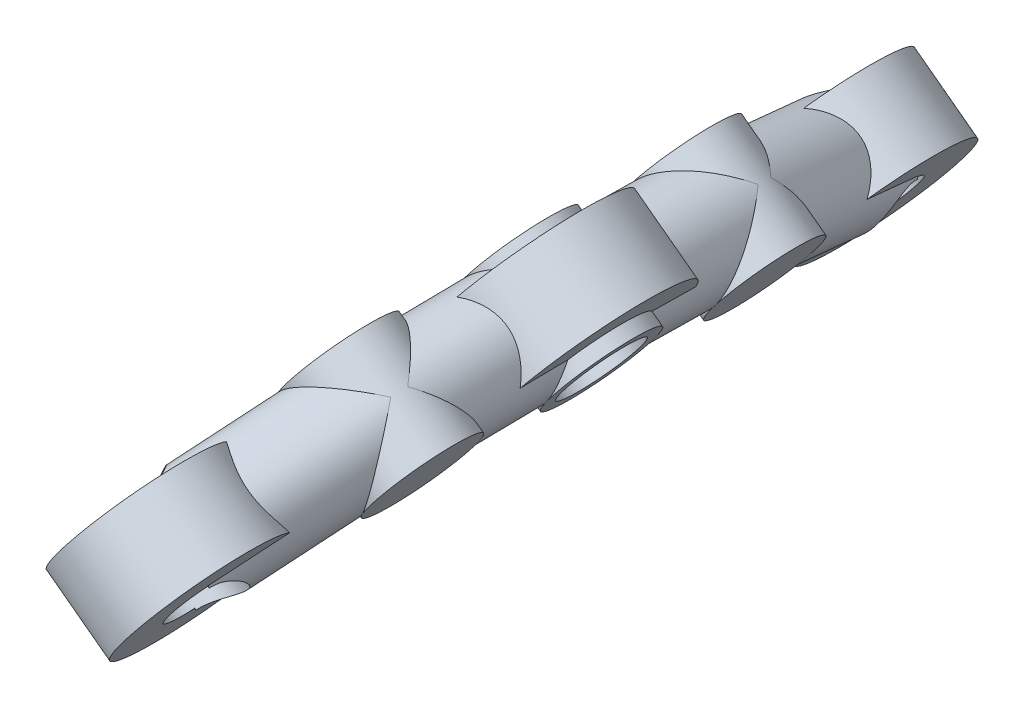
ISO-10303-21;
HEADER;
FILE_DESCRIPTION(('STEP AP214'),'2;1');
FILE_NAME('part.step','',(''),(''),'','','');
FILE_SCHEMA(('AUTOMOTIVE_DESIGN { 1 0 10303 214 1 1 1 1 }'));
ENDSEC;
DATA;
#1=APPLICATION_CONTEXT('core data for automotive mechanical design processes');
#2=APPLICATION_PROTOCOL_DEFINITION('international standard','automotive_design',2000,#1);
#3=PRODUCT_CONTEXT('',#1,'mechanical');
#4=PRODUCT('Part','Part','',(#3));
#5=PRODUCT_RELATED_PRODUCT_CATEGORY('part','',(#4));
#6=PRODUCT_DEFINITION_FORMATION('','',#4);
#7=PRODUCT_DEFINITION_CONTEXT('part definition',#1,'design');
#8=PRODUCT_DEFINITION('design','',#6,#7);
#9=PRODUCT_DEFINITION_SHAPE('','',#8);
#10=(LENGTH_UNIT() NAMED_UNIT(*) SI_UNIT(.MILLI.,.METRE.));
#11=(NAMED_UNIT(*) PLANE_ANGLE_UNIT() SI_UNIT($,.RADIAN.));
#12=(NAMED_UNIT(*) SI_UNIT($,.STERADIAN.) SOLID_ANGLE_UNIT());
#13=UNCERTAINTY_MEASURE_WITH_UNIT(LENGTH_MEASURE(1.E-05),#10,'distance_accuracy_value','');
#14=(GEOMETRIC_REPRESENTATION_CONTEXT(3) GLOBAL_UNCERTAINTY_ASSIGNED_CONTEXT((#13)) GLOBAL_UNIT_ASSIGNED_CONTEXT((#10,
#11,#12)) REPRESENTATION_CONTEXT('',''));
#15=CARTESIAN_POINT('',(0.,0.,0.));
#16=DIRECTION('',(0.,0.,1.));
#17=DIRECTION('',(1.,0.,0.));
#18=AXIS2_PLACEMENT_3D('',#15,#16,#17);
#19=CARTESIAN_POINT('',(-231.363734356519,348.939584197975,25.9999999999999));
#20=DIRECTION('',(-0.215073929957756,-0.287418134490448,0.93334560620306));
#21=DIRECTION('',(0.,-0.955711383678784,-0.294305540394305));
#22=AXIS2_PLACEMENT_3D('',#19,#20,#21);
#23=PLANE('',#22);
#24=DIRECTION('',(-0.800654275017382,0.5991266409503,0.));
#25=VECTOR('',#24,1.);
#26=CARTESIAN_POINT('',(-226.763136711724,348.411295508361,26.8974476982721));
#27=LINE('',#26,#25);
#28=CARTESIAN_POINT('',(-227.465711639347,348.937029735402,26.8974476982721));
#29=VERTEX_POINT('',#28);
#30=CARTESIAN_POINT('',(-227.563790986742,349.010422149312,26.8974476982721));
#31=VERTEX_POINT('',#30);
#32=EDGE_CURVE('E127',#29,#31,#27,.T.);
#33=ORIENTED_EDGE('',*,*,#32,.F.);
#34=CARTESIAN_POINT('',(-231.363734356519,348.939584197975,25.9999999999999));
#35=DIRECTION('',(-0.215073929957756,-0.287418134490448,0.93334560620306));
#36=DIRECTION('',(0.,-0.955711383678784,-0.294305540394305));
#37=AXIS2_PLACEMENT_3D('',#34,#35,#36);
#38=CIRCLE('',#37,3.99999999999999);
#39=CARTESIAN_POINT('',(-227.482287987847,349.119340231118,26.9497693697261));
#40=VERTEX_POINT('',#39);
#41=EDGE_CURVE('E427',#29,#40,#38,.T.);
#42=ORIENTED_EDGE('',*,*,#41,.T.);
#43=DIRECTION('',(-0.55919221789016,-0.747287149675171,-0.358979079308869));
#44=VECTOR('',#43,1.);
#45=CARTESIAN_POINT('',(-228.961771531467,347.142204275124,25.9999999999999));
#46=LINE('',#45,#44);
#47=EDGE_CURVE('E352',#40,#31,#46,.T.);
#48=ORIENTED_EDGE('',*,*,#47,.T.);
#49=EDGE_LOOP('',(#33,#42,#48));
#50=FACE_BOUND('',#49,.T.);
#51=ADVANCED_FACE('F112',(#50),#23,.T.);
#52=DIRECTION('',(-0.800654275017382,0.5991266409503,0.));
#53=VECTOR('',#52,1.);
#54=CARTESIAN_POINT('',(-226.763136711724,348.411295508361,26.8974476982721));
#55=LINE('',#54,#53);
#56=CARTESIAN_POINT('',(-232.367716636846,352.605181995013,26.8974476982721));
#57=VERTEX_POINT('',#56);
#58=CARTESIAN_POINT('',(-232.46579598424,352.678574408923,26.8974476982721));
#59=VERTEX_POINT('',#58);
#60=EDGE_CURVE('E331',#57,#59,#55,.T.);
#61=ORIENTED_EDGE('',*,*,#60,.F.);
#62=DIRECTION('',(-0.55919221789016,-0.747287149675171,-0.358979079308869));
#63=VECTOR('',#62,1.);
#64=CARTESIAN_POINT('',(-233.765697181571,350.736964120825,25.9999999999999));
#65=LINE('',#64,#63);
#66=CARTESIAN_POINT('',(-232.286213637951,352.71410007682,26.9497693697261));
#67=VERTEX_POINT('',#66);
#68=EDGE_CURVE('E340',#67,#57,#65,.T.);
#69=ORIENTED_EDGE('',*,*,#68,.F.);
#70=EDGE_CURVE('E342',#67,#59,#38,.T.);
#71=ORIENTED_EDGE('',*,*,#70,.T.);
#72=EDGE_LOOP('',(#61,#69,#71));
#73=FACE_BOUND('',#72,.T.);
#74=ADVANCED_FACE('F339',(#73),#23,.T.);
#75=CARTESIAN_POINT('',(-231.363734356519,348.939584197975,-26.));
#76=DIRECTION('',(0.215073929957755,0.287418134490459,0.933345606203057));
#77=DIRECTION('',(0.,-0.955711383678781,0.294305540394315));
#78=AXIS2_PLACEMENT_3D('',#75,#76,#77);
#79=PLANE('',#78);
#80=CARTESIAN_POINT('',(-231.363734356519,348.939584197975,-26.));
#81=DIRECTION('',(0.215073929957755,0.287418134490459,0.933345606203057));
#82=DIRECTION('',(0.,-0.955711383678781,0.294305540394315));
#83=AXIS2_PLACEMENT_3D('',#80,#81,#82);
#84=CIRCLE('',#83,3.99999999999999);
#85=CARTESIAN_POINT('',(-227.465711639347,348.937029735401,-26.8974476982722));
#86=VERTEX_POINT('',#85);
#87=CARTESIAN_POINT('',(-227.482287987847,349.119340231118,-26.9497693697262));
#88=VERTEX_POINT('',#87);
#89=EDGE_CURVE('E432',#86,#88,#84,.T.);
#90=ORIENTED_EDGE('',*,*,#89,.F.);
#91=DIRECTION('',(-0.800654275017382,0.5991266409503,0.));
#92=VECTOR('',#91,1.);
#93=CARTESIAN_POINT('',(-226.763136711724,348.411295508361,-26.8974476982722));
#94=LINE('',#93,#92);
#95=CARTESIAN_POINT('',(-227.563790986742,349.010422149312,-26.8974476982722));
#96=VERTEX_POINT('',#95);
#97=EDGE_CURVE('E616',#86,#96,#94,.T.);
#98=ORIENTED_EDGE('',*,*,#97,.T.);
#99=DIRECTION('',(-0.559192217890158,-0.747287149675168,0.358979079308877));
#100=VECTOR('',#99,1.);
#101=CARTESIAN_POINT('',(-228.961771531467,347.142204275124,-26.));
#102=LINE('',#101,#100);
#103=EDGE_CURVE('E466',#88,#96,#102,.T.);
#104=ORIENTED_EDGE('',*,*,#103,.F.);
#105=EDGE_LOOP('',(#90,#98,#104));
#106=FACE_BOUND('',#105,.T.);
#107=ADVANCED_FACE('F718',(#106),#79,.F.);
#108=DIRECTION('',(-0.559192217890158,-0.747287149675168,0.358979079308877));
#109=VECTOR('',#108,1.);
#110=CARTESIAN_POINT('',(-233.765697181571,350.736964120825,-26.));
#111=LINE('',#110,#109);
#112=CARTESIAN_POINT('',(-232.286213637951,352.71410007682,-26.9497693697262));
#113=VERTEX_POINT('',#112);
#114=CARTESIAN_POINT('',(-232.367716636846,352.605181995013,-26.8974476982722));
#115=VERTEX_POINT('',#114);
#116=EDGE_CURVE('E461',#113,#115,#111,.T.);
#117=ORIENTED_EDGE('',*,*,#116,.T.);
#118=DIRECTION('',(-0.800654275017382,0.5991266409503,0.));
#119=VECTOR('',#118,1.);
#120=CARTESIAN_POINT('',(-226.763136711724,348.411295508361,-26.8974476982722));
#121=LINE('',#120,#119);
#122=CARTESIAN_POINT('',(-232.46579598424,352.678574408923,-26.8974476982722));
#123=VERTEX_POINT('',#122);
#124=EDGE_CURVE('E601',#115,#123,#121,.T.);
#125=ORIENTED_EDGE('',*,*,#124,.T.);
#126=EDGE_CURVE('E433',#113,#123,#84,.T.);
#127=ORIENTED_EDGE('',*,*,#126,.F.);
#128=EDGE_LOOP('',(#117,#125,#127));
#129=FACE_BOUND('',#128,.T.);
#130=ADVANCED_FACE('F710',(#129),#79,.F.);
#131=CARTESIAN_POINT('',(-227.768974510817,353.743509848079,0.));
#132=DIRECTION('',(-0.0459509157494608,-0.0614073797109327,0.997054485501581));
#133=DIRECTION('',(0.,-0.99810878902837,-0.0614723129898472));
#134=AXIS2_PLACEMENT_3D('',#131,#132,#133);
#135=CYLINDRICAL_SURFACE('',#134,3.99999999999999);
#136=CARTESIAN_POINT('',(-228.368101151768,352.942855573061,13.));
#137=DIRECTION('',(-0.598640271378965,0.380224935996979,0.705023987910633));
#138=DIRECTION('',(0.533655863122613,-0.467068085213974,0.705023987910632));
#139=AXIS2_PLACEMENT_3D('',#136,#137,#138);
#140=ELLIPSE('',#139,5.65685424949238,3.99999999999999);
#141=CARTESIAN_POINT('',(-231.386914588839,355.584991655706,9.01178205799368));
#142=VERTEX_POINT('',#141);
#143=CARTESIAN_POINT('',(-231.169200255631,350.165568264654,12.1193819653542));
#144=VERTEX_POINT('',#143);
#145=EDGE_CURVE('E384',#142,#144,#140,.T.);
#146=ORIENTED_EDGE('',*,*,#145,.F.);
#147=CARTESIAN_POINT('',(-225.978653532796,356.13603931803,13.3067859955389));
#148=VERTEX_POINT('',#147);
#149=EDGE_CURVE('E387',#148,#142,#140,.T.);
#150=ORIENTED_EDGE('',*,*,#149,.F.);
#151=CARTESIAN_POINT('',(-228.368101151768,352.942855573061,13.));
#152=DIRECTION('',(0.533655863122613,-0.467068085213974,0.705023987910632));
#153=DIRECTION('',(-0.598640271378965,0.380224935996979,0.705023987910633));
#154=AXIS2_PLACEMENT_3D('',#151,#152,#153);
#155=ELLIPSE('',#154,5.65685424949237,3.99999999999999);
#156=CARTESIAN_POINT('',(-224.9816803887,350.791978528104,9.01178205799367));
#157=VERTEX_POINT('',#156);
#158=EDGE_CURVE('E388',#157,#148,#155,.T.);
#159=ORIENTED_EDGE('',*,*,#158,.F.);
#160=CARTESIAN_POINT('',(-230.242418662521,349.472061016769,12.1193819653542));
#161=VERTEX_POINT('',#160);
#162=EDGE_CURVE('E391',#161,#157,#155,.T.);
#163=ORIENTED_EDGE('',*,*,#162,.F.);
#164=CARTESIAN_POINT('',(-228.368101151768,352.942855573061,12.9999999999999));
#165=DIRECTION('',(-0.13190043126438,-0.17626764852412,0.975465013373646));
#166=DIRECTION('',(0.584427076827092,0.781010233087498,0.220154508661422));
#167=AXIS2_PLACEMENT_3D('',#164,#165,#166);
#168=ELLIPSE('',#167,4.0425402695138,3.99999999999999);
#169=EDGE_CURVE('E436',#144,#161,#168,.T.);
#170=ORIENTED_EDGE('',*,*,#169,.F.);
#171=EDGE_LOOP('',(#146,#150,#159,#163,#170));
#172=FACE_BOUND('',#171,.T.);
#173=CARTESIAN_POINT('',(-227.245278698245,349.436072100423,6.25873172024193));
#174=CARTESIAN_POINT('',(-227.354537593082,349.415258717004,6.21759868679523));
#175=CARTESIAN_POINT('',(-227.464520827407,349.399223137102,6.17613484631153));
#176=CARTESIAN_POINT('',(-227.685579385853,349.376691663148,6.09344404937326));
#177=CARTESIAN_POINT('',(-227.796654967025,349.370198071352,6.05221715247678));
#178=CARTESIAN_POINT('',(-228.132616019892,349.364991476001,5.92964649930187));
#179=CARTESIAN_POINT('',(-228.358546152,349.380873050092,5.85007253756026));
#180=CARTESIAN_POINT('',(-228.809533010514,349.451939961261,5.70415583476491));
#181=CARTESIAN_POINT('',(-229.03458531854,349.507238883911,5.63785204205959));
#182=CARTESIAN_POINT('',(-229.365863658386,349.619513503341,5.55572409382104));
#183=CARTESIAN_POINT('',(-229.47509135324,349.661746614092,5.53125823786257));
#184=CARTESIAN_POINT('',(-229.690701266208,349.755837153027,5.48907395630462));
#185=CARTESIAN_POINT('',(-229.797084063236,349.807692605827,5.47135414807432));
#186=CARTESIAN_POINT('',(-229.994053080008,349.914284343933,5.44511484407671));
#187=CARTESIAN_POINT('',(-230.08506656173,349.968034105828,5.43578238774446));
#188=CARTESIAN_POINT('',(-230.263107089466,350.08241773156,5.42350659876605));
#189=CARTESIAN_POINT('',(-230.350134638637,350.143050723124,5.42056245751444));
#190=CARTESIAN_POINT('',(-230.519396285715,350.270675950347,5.42119563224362));
#191=CARTESIAN_POINT('',(-230.601629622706,350.337669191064,5.42477398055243));
#192=CARTESIAN_POINT('',(-230.76052543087,350.477330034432,5.43828468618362));
#193=CARTESIAN_POINT('',(-230.837188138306,350.549997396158,5.44821677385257));
#194=CARTESIAN_POINT('',(-231.039988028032,350.757199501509,5.48382353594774));
#195=CARTESIAN_POINT('',(-231.159757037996,350.89700620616,5.5157225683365));
#196=CARTESIAN_POINT('',(-231.378058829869,351.188406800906,5.59431827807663));
#197=CARTESIAN_POINT('',(-231.476578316,351.340007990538,5.6410241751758));
#198=CARTESIAN_POINT('',(-231.660511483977,351.6682796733,5.7502273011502));
#199=CARTESIAN_POINT('',(-231.743508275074,351.845919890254,5.81385953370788));
#200=CARTESIAN_POINT('',(-231.881812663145,352.209020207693,5.94803926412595));
#201=CARTESIAN_POINT('',(-231.937139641,352.39447473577,6.01858188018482));
#202=CARTESIAN_POINT('',(-231.99456218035,352.656574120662,6.11802155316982));
#203=CARTESIAN_POINT('',(-232.00859382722,352.731017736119,6.14623705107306));
#204=CARTESIAN_POINT('',(-232.032220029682,352.880484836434,6.20259525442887));
#205=CARTESIAN_POINT('',(-232.041822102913,352.955507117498,6.23073800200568));
#206=CARTESIAN_POINT('',(-232.04920434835,353.030831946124,6.25873172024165));
#207=B_SPLINE_CURVE_WITH_KNOTS('',3,(#173,#174,#175,#176,#177,#178,#179,#180,#181,#182,#183,
#184,#185,#186,#187,#188,#189,#190,#191,#192,#193,#194,#195,#196,#197,#198,#199,#200,#201,#202,
#203,#204,#205,#206),.UNSPECIFIED.,.F.,.F.,(4,2,2,2,2,2,2,2,2,2,2,2,2,2,2,2,4),(0.,
0.355549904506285,0.711185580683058,1.42791733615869,2.14672282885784,2.50512435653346,
2.86345238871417,3.18131765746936,3.49914268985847,3.81701802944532,4.13487987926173,
4.69283164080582,5.25113150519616,5.86729994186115,6.48303618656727,6.72545410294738,
6.96745907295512),.UNSPECIFIED.);
#208=CARTESIAN_POINT('',(-227.245278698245,349.436072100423,6.25873172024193));
#209=VERTEX_POINT('',#208);
#210=CARTESIAN_POINT('',(-232.04920434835,353.030831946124,6.25873172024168));
#211=VERTEX_POINT('',#210);
#212=EDGE_CURVE('E665',#209,#211,#207,.T.);
#213=ORIENTED_EDGE('',*,*,#212,.F.);
#214=DIRECTION('',(-0.0459509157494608,-0.0614073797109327,0.997054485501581));
#215=VECTOR('',#214,1.);
#216=CARTESIAN_POINT('',(-226.947482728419,349.834037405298,-0.202919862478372));
#217=LINE('',#216,#215);
#218=CARTESIAN_POINT('',(-227.085335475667,349.649815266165,2.78824359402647));
#219=VERTEX_POINT('',#218);
#220=EDGE_CURVE('E656',#209,#219,#217,.F.);
#221=ORIENTED_EDGE('',*,*,#220,.T.);
#222=CARTESIAN_POINT('',(-227.768974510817,353.743509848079,0.));
#223=DIRECTION('',(-0.598640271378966,0.380224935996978,0.705023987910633));
#224=DIRECTION('',(0.533655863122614,-0.467068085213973,0.705023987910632));
#225=AXIS2_PLACEMENT_3D('',#222,#223,#224);
#226=ELLIPSE('',#225,5.65685424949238,3.99999999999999);
#227=CARTESIAN_POINT('',(-224.750161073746,351.101373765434,3.98821794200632));
#228=VERTEX_POINT('',#227);
#229=EDGE_CURVE('E452',#228,#219,#226,.F.);
#230=ORIENTED_EDGE('',*,*,#229,.F.);
#231=CARTESIAN_POINT('',(-223.92439339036,353.874000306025,3.19408331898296));
#232=VERTEX_POINT('',#231);
#233=EDGE_CURVE('E450',#232,#228,#226,.F.);
#234=ORIENTED_EDGE('',*,*,#233,.F.);
#235=DIRECTION('',(-0.0459509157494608,-0.0614073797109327,0.997054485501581));
#236=VECTOR('',#235,1.);
#237=CARTESIAN_POINT('',(-223.786540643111,354.058222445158,0.202919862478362));
#238=LINE('',#237,#236);
#239=CARTESIAN_POINT('',(-224.084336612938,353.660257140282,6.66457144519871));
#240=VERTEX_POINT('',#239);
#241=EDGE_CURVE('E650',#232,#240,#238,.T.);
#242=ORIENTED_EDGE('',*,*,#241,.T.);
#243=CARTESIAN_POINT('',(-228.888262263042,357.255016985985,6.6645714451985));
#244=CARTESIAN_POINT('',(-228.775813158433,357.280093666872,6.63648250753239));
#245=CARTESIAN_POINT('',(-228.662585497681,357.300464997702,6.60754797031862));
#246=CARTESIAN_POINT('',(-228.435010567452,357.331704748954,6.54884489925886));
#247=CARTESIAN_POINT('',(-228.320663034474,357.342570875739,6.51907616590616));
#248=CARTESIAN_POINT('',(-227.97491883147,357.360851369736,6.42936957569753));
#249=CARTESIAN_POINT('',(-227.742561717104,357.353558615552,6.36948926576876));
#250=CARTESIAN_POINT('',(-227.279707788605,357.298350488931,6.25791131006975));
#251=CARTESIAN_POINT('',(-227.04921830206,357.250317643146,6.20623784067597));
#252=CARTESIAN_POINT('',(-226.711179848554,357.147077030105,6.14168314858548));
#253=CARTESIAN_POINT('',(-226.599933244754,357.107541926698,6.12234221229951));
#254=CARTESIAN_POINT('',(-226.380837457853,357.018109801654,6.08888912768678));
#255=CARTESIAN_POINT('',(-226.272987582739,356.968214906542,6.07477590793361));
#256=CARTESIAN_POINT('',(-226.073844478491,356.86452855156,6.05384131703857));
#257=CARTESIAN_POINT('',(-225.982056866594,356.811813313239,6.04637650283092));
#258=CARTESIAN_POINT('',(-225.802997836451,356.69879078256,6.03655257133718));
#259=CARTESIAN_POINT('',(-225.715725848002,356.638484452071,6.03419280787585));
#260=CARTESIAN_POINT('',(-225.546516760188,356.510788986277,6.03470007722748));
#261=CARTESIAN_POINT('',(-225.464580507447,356.443398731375,6.03756793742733));
#262=CARTESIAN_POINT('',(-225.306805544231,356.302240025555,6.0483776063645));
#263=CARTESIAN_POINT('',(-225.230966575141,356.228471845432,6.05631919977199));
#264=CARTESIAN_POINT('',(-225.031116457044,356.017327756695,6.0847173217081));
#265=CARTESIAN_POINT('',(-224.913987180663,355.873993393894,6.11009589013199));
#266=CARTESIAN_POINT('',(-224.70216458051,355.573934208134,6.17208730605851));
#267=CARTESIAN_POINT('',(-224.60748529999,355.417201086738,6.20870715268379));
#268=CARTESIAN_POINT('',(-224.432482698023,355.076994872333,6.29328168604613));
#269=CARTESIAN_POINT('',(-224.354664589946,354.892434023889,6.34201781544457));
#270=CARTESIAN_POINT('',(-224.227190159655,354.514860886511,6.44282922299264));
#271=CARTESIAN_POINT('',(-224.177514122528,354.321854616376,6.49490213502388));
#272=CARTESIAN_POINT('',(-224.127966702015,354.049231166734,6.56633876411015));
#273=CARTESIAN_POINT('',(-224.116159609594,353.971814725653,6.58639220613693));
#274=CARTESIAN_POINT('',(-224.096953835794,353.816440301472,6.62594957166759));
#275=CARTESIAN_POINT('',(-224.089547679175,353.738483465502,6.64545437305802));
#276=CARTESIAN_POINT('',(-224.084336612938,353.660257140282,6.66457144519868));
#277=B_SPLINE_CURVE_WITH_KNOTS('',3,(#243,#244,#245,#246,#247,#248,#249,#250,#251,#252,#253,
#254,#255,#256,#257,#258,#259,#260,#261,#262,#263,#264,#265,#266,#267,#268,#269,#270,#271,#272,
#273,#274,#275,#276),.UNSPECIFIED.,.F.,.F.,(4,2,2,2,2,2,2,2,2,2,2,2,2,2,2,2,4),(0.,
0.355549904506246,0.711185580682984,1.42791733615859,2.14672282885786,2.50512435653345,
2.86345238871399,3.18131765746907,3.49914268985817,3.81701802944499,4.13487987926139,
4.6928316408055,5.2511315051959,5.86729994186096,6.48303618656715,6.72545410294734,
6.96745907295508),.UNSPECIFIED.);
#278=CARTESIAN_POINT('',(-228.888262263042,357.255016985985,6.6645714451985));
#279=VERTEX_POINT('',#278);
#280=EDGE_CURVE('E658',#279,#240,#277,.T.);
#281=ORIENTED_EDGE('',*,*,#280,.F.);
#282=DIRECTION('',(-0.0459509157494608,-0.0614073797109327,0.997054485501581));
#283=VECTOR('',#282,1.);
#284=CARTESIAN_POINT('',(-228.590466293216,357.65298229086,0.202919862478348));
#285=LINE('',#284,#283);
#286=CARTESIAN_POINT('',(-228.728319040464,357.468760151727,3.19408331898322));
#287=VERTEX_POINT('',#286);
#288=EDGE_CURVE('E645',#287,#279,#285,.T.);
#289=ORIENTED_EDGE('',*,*,#288,.F.);
#290=CARTESIAN_POINT('',(-227.768974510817,353.743509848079,0.));
#291=DIRECTION('',(0.533655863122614,-0.467068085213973,0.705023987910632));
#292=DIRECTION('',(-0.598640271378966,0.380224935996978,0.705023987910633));
#293=AXIS2_PLACEMENT_3D('',#290,#291,#292);
#294=ELLIPSE('',#293,5.65685424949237,3.99999999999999);
#295=CARTESIAN_POINT('',(-231.155395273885,355.894386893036,3.98821794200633));
#296=VERTEX_POINT('',#295);
#297=EDGE_CURVE('E447',#296,#287,#294,.F.);
#298=ORIENTED_EDGE('',*,*,#297,.F.);
#299=CARTESIAN_POINT('',(-231.889261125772,353.244575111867,2.78824359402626));
#300=VERTEX_POINT('',#299);
#301=EDGE_CURVE('E449',#300,#296,#294,.F.);
#302=ORIENTED_EDGE('',*,*,#301,.F.);
#303=DIRECTION('',(-0.0459509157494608,-0.0614073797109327,0.997054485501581));
#304=VECTOR('',#303,1.);
#305=CARTESIAN_POINT('',(-231.751408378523,353.428797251,-0.202919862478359));
#306=LINE('',#305,#304);
#307=EDGE_CURVE('E636',#211,#300,#306,.F.);
#308=ORIENTED_EDGE('',*,*,#307,.F.);
#309=EDGE_LOOP('',(#213,#221,#230,#234,#242,#281,#289,#298,#302,#308));
#310=FACE_BOUND('',#309,.T.);
#311=ADVANCED_FACE('F670',(#172,#310),#135,.T.);
#312=CARTESIAN_POINT('',(-228.368101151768,352.942855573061,-13.));
#313=DIRECTION('',(0.0459509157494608,0.0614073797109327,0.997054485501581));
#314=DIRECTION('',(0.,-0.99810878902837,0.0614723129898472));
#315=AXIS2_PLACEMENT_3D('',#312,#313,#314);
#316=CYLINDRICAL_SURFACE('',#315,3.99999999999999);
#317=CARTESIAN_POINT('',(-228.368101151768,352.942855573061,-13.));
#318=DIRECTION('',(-0.533655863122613,0.467068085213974,0.705023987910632));
#319=DIRECTION('',(0.598640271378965,-0.380224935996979,0.705023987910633));
#320=AXIS2_PLACEMENT_3D('',#317,#318,#319);
#321=ELLIPSE('',#320,5.65685424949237,3.99999999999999);
#322=CARTESIAN_POINT('',(-224.9816803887,350.791978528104,-9.01178205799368));
#323=VERTEX_POINT('',#322);
#324=CARTESIAN_POINT('',(-230.242418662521,349.472061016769,-12.1193819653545));
#325=VERTEX_POINT('',#324);
#326=EDGE_CURVE('E446',#323,#325,#321,.F.);
#327=ORIENTED_EDGE('',*,*,#326,.F.);
#328=CARTESIAN_POINT('',(-225.978653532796,356.13603931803,-13.306785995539));
#329=VERTEX_POINT('',#328);
#330=EDGE_CURVE('E443',#329,#323,#321,.F.);
#331=ORIENTED_EDGE('',*,*,#330,.F.);
#332=CARTESIAN_POINT('',(-228.368101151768,352.942855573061,-13.));
#333=DIRECTION('',(0.598640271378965,-0.380224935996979,0.705023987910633));
#334=DIRECTION('',(-0.533655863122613,0.467068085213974,0.705023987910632));
#335=AXIS2_PLACEMENT_3D('',#332,#333,#334);
#336=ELLIPSE('',#335,5.65685424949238,3.99999999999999);
#337=CARTESIAN_POINT('',(-231.386914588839,355.584991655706,-9.01178205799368));
#338=VERTEX_POINT('',#337);
#339=EDGE_CURVE('E439',#338,#329,#336,.F.);
#340=ORIENTED_EDGE('',*,*,#339,.F.);
#341=CARTESIAN_POINT('',(-231.169200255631,350.165568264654,-12.1193819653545));
#342=VERTEX_POINT('',#341);
#343=EDGE_CURVE('E442',#342,#338,#336,.F.);
#344=ORIENTED_EDGE('',*,*,#343,.F.);
#345=CARTESIAN_POINT('',(-228.368101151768,352.942855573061,-13.0000000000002));
#346=DIRECTION('',(0.13190043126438,0.17626764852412,0.975465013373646));
#347=DIRECTION('',(0.584427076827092,0.781010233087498,-0.220154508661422));
#348=AXIS2_PLACEMENT_3D('',#345,#346,#347);
#349=ELLIPSE('',#348,4.0425402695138,3.99999999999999);
#350=EDGE_CURVE('E431',#342,#325,#349,.T.);
#351=ORIENTED_EDGE('',*,*,#350,.T.);
#352=EDGE_LOOP('',(#327,#331,#340,#344,#351));
#353=FACE_BOUND('',#352,.T.);
#354=CARTESIAN_POINT('',(-224.084336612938,353.660257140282,-6.66457144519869));
#355=CARTESIAN_POINT('',(-224.091999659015,353.77521330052,-6.63648250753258));
#356=CARTESIAN_POINT('',(-224.104396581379,353.889589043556,-6.60754797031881));
#357=CARTESIAN_POINT('',(-224.13862322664,354.116733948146,-6.54884489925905));
#358=CARTESIAN_POINT('',(-224.160455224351,354.229502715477,-6.51907616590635));
#359=CARTESIAN_POINT('',(-224.240449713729,354.566361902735,-6.42936957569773));
#360=CARTESIAN_POINT('',(-224.312992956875,354.787224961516,-6.36948926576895));
#361=CARTESIAN_POINT('',(-224.49652745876,355.215706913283,-6.25791131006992));
#362=CARTESIAN_POINT('',(-224.607629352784,355.42328563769,-6.20623784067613));
#363=CARTESIAN_POINT('',(-224.802035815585,355.718471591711,-6.14168314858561));
#364=CARTESIAN_POINT('',(-224.871347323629,355.814047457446,-6.12234221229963));
#365=CARTESIAN_POINT('',(-225.018953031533,355.999016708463,-6.08888912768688));
#366=CARTESIAN_POINT('',(-225.097245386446,356.088411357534,-6.07477590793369));
#367=CARTESIAN_POINT('',(-225.252897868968,356.250217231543,-6.05384131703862));
#368=CARTESIAN_POINT('',(-225.329364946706,356.323406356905,-6.04637650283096));
#369=CARTESIAN_POINT('',(-225.488308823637,356.463310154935,-6.0365525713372));
#370=CARTESIAN_POINT('',(-225.570784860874,356.530025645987,-6.03419280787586));
#371=CARTESIAN_POINT('',(-225.741027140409,356.656340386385,-6.03470007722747));
#372=CARTESIAN_POINT('',(-225.828794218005,356.715938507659,-6.0375679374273));
#373=CARTESIAN_POINT('',(-226.008727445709,356.827485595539,-6.04837760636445));
#374=CARTESIAN_POINT('',(-226.100893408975,356.879434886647,-6.05631919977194));
#375=CARTESIAN_POINT('',(-226.359838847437,357.011605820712,-6.08471732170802));
#376=CARTESIAN_POINT('',(-226.530393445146,357.083544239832,-6.1100958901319));
#377=CARTESIAN_POINT('',(-226.878020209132,357.202118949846,-6.17208730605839));
#378=CARTESIAN_POINT('',(-227.055096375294,357.248739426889,-6.20870715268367));
#379=CARTESIAN_POINT('',(-227.430852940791,357.320664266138,-6.29328168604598));
#380=CARTESIAN_POINT('',(-227.629870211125,357.343258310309,-6.34201781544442));
#381=CARTESIAN_POINT('',(-228.028068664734,357.35904425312,-6.44282922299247));
#382=CARTESIAN_POINT('',(-228.227249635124,357.352256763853,-6.49490213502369));
#383=CARTESIAN_POINT('',(-228.502777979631,357.322886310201,-6.56633876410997));
#384=CARTESIAN_POINT('',(-228.580380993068,357.312375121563,-6.58639220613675));
#385=CARTESIAN_POINT('',(-228.734862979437,357.286970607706,-6.62594957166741));
#386=CARTESIAN_POINT('',(-228.811742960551,357.272084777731,-6.64545437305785));
#387=CARTESIAN_POINT('',(-228.888262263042,357.255016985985,-6.66457144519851));
#388=B_SPLINE_CURVE_WITH_KNOTS('',3,(#354,#355,#356,#357,#358,#359,#360,#361,#362,#363,#364,
#365,#366,#367,#368,#369,#370,#371,#372,#373,#374,#375,#376,#377,#378,#379,#380,#381,#382,#383,
#384,#385,#386,#387),.UNSPECIFIED.,.F.,.F.,(4,2,2,2,2,2,2,2,2,2,2,2,2,2,2,2,4),(0.,
0.355549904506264,0.711185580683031,1.42791733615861,2.14672282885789,2.50512435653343,
2.86345238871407,3.18131765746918,3.49914268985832,3.81701802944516,4.13487987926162,
4.6928316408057,5.25113150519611,5.8672999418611,6.48303618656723,6.72545410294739,
6.96745907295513),.UNSPECIFIED.);
#389=CARTESIAN_POINT('',(-224.084336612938,353.660257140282,-6.66457144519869));
#390=VERTEX_POINT('',#389);
#391=CARTESIAN_POINT('',(-228.888262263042,357.255016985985,-6.66457144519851));
#392=VERTEX_POINT('',#391);
#393=EDGE_CURVE('E693',#390,#392,#388,.T.);
#394=ORIENTED_EDGE('',*,*,#393,.F.);
#395=DIRECTION('',(0.0459509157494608,0.0614073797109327,0.997054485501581));
#396=VECTOR('',#395,1.);
#397=CARTESIAN_POINT('',(-224.385667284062,353.257568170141,-13.2029198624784));
#398=LINE('',#397,#396);
#399=CARTESIAN_POINT('',(-223.92439339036,353.874000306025,-3.19408331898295));
#400=VERTEX_POINT('',#399);
#401=EDGE_CURVE('E648',#390,#400,#398,.T.);
#402=ORIENTED_EDGE('',*,*,#401,.T.);
#403=CARTESIAN_POINT('',(-227.768974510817,353.743509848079,0.));
#404=DIRECTION('',(0.598640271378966,-0.380224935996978,0.705023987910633));
#405=DIRECTION('',(-0.533655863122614,0.467068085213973,0.705023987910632));
#406=AXIS2_PLACEMENT_3D('',#403,#404,#405);
#407=ELLIPSE('',#406,5.65685424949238,3.99999999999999);
#408=CARTESIAN_POINT('',(-224.750161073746,351.101373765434,-3.98821794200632));
#409=VERTEX_POINT('',#408);
#410=EDGE_CURVE('E403',#409,#400,#407,.T.);
#411=ORIENTED_EDGE('',*,*,#410,.F.);
#412=CARTESIAN_POINT('',(-227.085335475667,349.649815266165,-2.78824359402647));
#413=VERTEX_POINT('',#412);
#414=EDGE_CURVE('E406',#413,#409,#407,.T.);
#415=ORIENTED_EDGE('',*,*,#414,.F.);
#416=DIRECTION('',(0.0459509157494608,0.0614073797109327,0.997054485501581));
#417=VECTOR('',#416,1.);
#418=CARTESIAN_POINT('',(-227.546609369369,349.03338313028,-12.7970801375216));
#419=LINE('',#418,#417);
#420=CARTESIAN_POINT('',(-227.245278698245,349.436072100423,-6.25873172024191));
#421=VERTEX_POINT('',#420);
#422=EDGE_CURVE('E654',#413,#421,#419,.F.);
#423=ORIENTED_EDGE('',*,*,#422,.T.);
#424=CARTESIAN_POINT('',(-232.04920434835,353.030831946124,-6.25873172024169));
#425=CARTESIAN_POINT('',(-232.038351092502,352.920139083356,-6.21759868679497));
#426=CARTESIAN_POINT('',(-232.022709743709,352.810099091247,-6.17613484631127));
#427=CARTESIAN_POINT('',(-231.981966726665,352.591662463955,-6.093444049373));
#428=CARTESIAN_POINT('',(-231.956862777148,352.483266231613,-6.05221715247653));
#429=CARTESIAN_POINT('',(-231.867085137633,352.159480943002,-5.92964649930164));
#430=CARTESIAN_POINT('',(-231.78811491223,351.947206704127,-5.85007253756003));
#431=CARTESIAN_POINT('',(-231.59271334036,351.534583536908,-5.7041558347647));
#432=CARTESIAN_POINT('',(-231.476174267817,351.334270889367,-5.63785204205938));
#433=CARTESIAN_POINT('',(-231.275007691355,351.048118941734,-5.55572409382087));
#434=CARTESIAN_POINT('',(-231.203677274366,350.955241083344,-5.53125823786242));
#435=CARTESIAN_POINT('',(-231.052585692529,350.774930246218,-5.48907395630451));
#436=CARTESIAN_POINT('',(-230.972826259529,350.687496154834,-5.47135414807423));
#437=CARTESIAN_POINT('',(-230.814999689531,350.52859566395,-5.44511484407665));
#438=CARTESIAN_POINT('',(-230.737758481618,350.456441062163,-5.43578238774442));
#439=CARTESIAN_POINT('',(-230.577796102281,350.317898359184,-5.42350659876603));
#440=CARTESIAN_POINT('',(-230.495075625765,350.251509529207,-5.42056245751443));
#441=CARTESIAN_POINT('',(-230.324885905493,350.125124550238,-5.42119563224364));
#442=CARTESIAN_POINT('',(-230.237415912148,350.065129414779,-5.42477398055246));
#443=CARTESIAN_POINT('',(-230.058603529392,349.952084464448,-5.43828468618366));
#444=CARTESIAN_POINT('',(-229.967261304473,349.899034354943,-5.44821677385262));
#445=CARTESIAN_POINT('',(-229.711265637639,349.762921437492,-5.48382353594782));
#446=CARTESIAN_POINT('',(-229.543350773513,349.687455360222,-5.51572256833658));
#447=CARTESIAN_POINT('',(-229.202203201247,349.560222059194,-5.59431827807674));
#448=CARTESIAN_POINT('',(-229.028967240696,349.508469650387,-5.64102417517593));
#449=CARTESIAN_POINT('',(-228.662141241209,349.424610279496,-5.75022730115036));
#450=CARTESIAN_POINT('',(-228.468302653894,349.395095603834,-5.81385953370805));
#451=CARTESIAN_POINT('',(-228.080934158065,349.364836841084,-5.94803926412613));
#452=CARTESIAN_POINT('',(-227.887404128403,349.364072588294,-6.01858188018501));
#453=CARTESIAN_POINT('',(-227.619750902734,349.382918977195,-6.11802155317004));
#454=CARTESIAN_POINT('',(-227.544372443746,349.39045734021,-6.14623705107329));
#455=CARTESIAN_POINT('',(-227.394310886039,349.4099545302,-6.20259525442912));
#456=CARTESIAN_POINT('',(-227.319626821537,349.42190580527,-6.23073800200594));
#457=CARTESIAN_POINT('',(-227.245278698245,349.436072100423,-6.25873172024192));
#458=B_SPLINE_CURVE_WITH_KNOTS('',3,(#424,#425,#426,#427,#428,#429,#430,#431,#432,#433,#434,
#435,#436,#437,#438,#439,#440,#441,#442,#443,#444,#445,#446,#447,#448,#449,#450,#451,#452,#453,
#454,#455,#456,#457),.UNSPECIFIED.,.F.,.F.,(4,2,2,2,2,2,2,2,2,2,2,2,2,2,2,2,4),(0.,
0.355549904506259,0.711185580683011,1.42791733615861,2.14672282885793,2.50512435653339,
2.86345238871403,3.18131765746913,3.49914268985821,3.81701802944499,4.13487987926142,
4.69283164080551,5.25113150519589,5.86729994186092,6.48303618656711,6.72545410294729,
6.9674590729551),.UNSPECIFIED.);
#459=CARTESIAN_POINT('',(-232.04920434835,353.030831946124,-6.25873172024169));
#460=VERTEX_POINT('',#459);
#461=EDGE_CURVE('E685',#460,#421,#458,.T.);
#462=ORIENTED_EDGE('',*,*,#461,.F.);
#463=DIRECTION('',(0.0459509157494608,0.0614073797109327,0.997054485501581));
#464=VECTOR('',#463,1.);
#465=CARTESIAN_POINT('',(-232.350535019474,352.628142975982,-12.7970801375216));
#466=LINE('',#465,#464);
#467=CARTESIAN_POINT('',(-231.889261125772,353.244575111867,-2.78824359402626));
#468=VERTEX_POINT('',#467);
#469=EDGE_CURVE('E633',#468,#460,#466,.F.);
#470=ORIENTED_EDGE('',*,*,#469,.F.);
#471=CARTESIAN_POINT('',(-227.768974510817,353.743509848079,0.));
#472=DIRECTION('',(-0.533655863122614,0.467068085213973,0.705023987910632));
#473=DIRECTION('',(0.598640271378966,-0.380224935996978,0.705023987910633));
#474=AXIS2_PLACEMENT_3D('',#471,#472,#473);
#475=ELLIPSE('',#474,5.65685424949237,3.99999999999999);
#476=CARTESIAN_POINT('',(-231.155395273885,355.894386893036,-3.98821794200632));
#477=VERTEX_POINT('',#476);
#478=EDGE_CURVE('E400',#477,#468,#475,.T.);
#479=ORIENTED_EDGE('',*,*,#478,.F.);
#480=CARTESIAN_POINT('',(-228.728319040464,357.468760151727,-3.19408331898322));
#481=VERTEX_POINT('',#480);
#482=EDGE_CURVE('E402',#481,#477,#475,.T.);
#483=ORIENTED_EDGE('',*,*,#482,.F.);
#484=DIRECTION('',(0.0459509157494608,0.0614073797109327,0.997054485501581));
#485=VECTOR('',#484,1.);
#486=CARTESIAN_POINT('',(-229.189592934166,356.852328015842,-13.2029198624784));
#487=LINE('',#486,#485);
#488=EDGE_CURVE('E642',#392,#481,#487,.T.);
#489=ORIENTED_EDGE('',*,*,#488,.F.);
#490=EDGE_LOOP('',(#394,#402,#411,#415,#423,#462,#470,#479,#483,#489));
#491=FACE_BOUND('',#490,.T.);
#492=ADVANCED_FACE('F699',(#353,#491),#316,.T.);
#493=CARTESIAN_POINT('',(-224.566357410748,351.347003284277,0.));
#494=DIRECTION('',(-0.800654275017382,0.5991266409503,0.));
#495=DIRECTION('',(-0.5991266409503,-0.800654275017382,0.));
#496=AXIS2_PLACEMENT_3D('',#493,#494,#495);
#497=CYLINDRICAL_SURFACE('',#496,4.);
#498=ORIENTED_EDGE('',*,*,#229,.T.);
#499=CARTESIAN_POINT('',(-225.367011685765,351.946129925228,0.));
#500=DIRECTION('',(-0.80065427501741,0.599126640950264,0.));
#501=DIRECTION('',(-0.599126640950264,-0.80065427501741,0.));
#502=AXIS2_PLACEMENT_3D('',#499,#500,#501);
#503=CIRCLE('',#502,4.);
#504=EDGE_CURVE('E652',#219,#413,#503,.F.);
#505=ORIENTED_EDGE('',*,*,#504,.T.);
#506=ORIENTED_EDGE('',*,*,#414,.T.);
#507=CARTESIAN_POINT('',(-224.566357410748,351.347003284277,0.));
#508=DIRECTION('',(-0.800654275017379,0.599126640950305,0.));
#509=DIRECTION('',(-0.599126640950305,-0.800654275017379,0.));
#510=AXIS2_PLACEMENT_3D('',#507,#508,#509);
#511=CIRCLE('',#510,4.);
#512=EDGE_CURVE('E396',#409,#228,#511,.T.);
#513=ORIENTED_EDGE('',*,*,#512,.T.);
#514=EDGE_LOOP('',(#498,#505,#506,#513));
#515=FACE_BOUND('',#514,.T.);
#516=ADVANCED_FACE('F522',(#515),#497,.T.);
#517=ORIENTED_EDGE('',*,*,#410,.T.);
#518=CARTESIAN_POINT('',(-225.367011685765,351.946129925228,0.));
#519=DIRECTION('',(-0.80065427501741,0.599126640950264,0.));
#520=DIRECTION('',(-0.599126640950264,-0.80065427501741,0.));
#521=AXIS2_PLACEMENT_3D('',#518,#519,#520);
#522=CIRCLE('',#521,4.);
#523=EDGE_CURVE('E793',#400,#232,#522,.F.);
#524=ORIENTED_EDGE('',*,*,#523,.T.);
#525=ORIENTED_EDGE('',*,*,#233,.T.);
#526=EDGE_CURVE('E392',#228,#409,#511,.T.);
#527=ORIENTED_EDGE('',*,*,#526,.T.);
#528=EDGE_LOOP('',(#517,#524,#525,#527));
#529=FACE_BOUND('',#528,.T.);
#530=ADVANCED_FACE('F708',(#529),#497,.T.);
#531=DIRECTION('',(-0.800654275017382,0.5991266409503,0.));
#532=VECTOR('',#531,1.);
#533=CARTESIAN_POINT('',(-229.559097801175,344.674859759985,25.1025523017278));
#534=LINE('',#533,#532);
#535=CARTESIAN_POINT('',(-230.359752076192,345.273986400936,25.1025523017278));
#536=VERTEX_POINT('',#535);
#537=CARTESIAN_POINT('',(-230.261672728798,345.200593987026,25.1025523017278));
#538=VERTEX_POINT('',#537);
#539=EDGE_CURVE('E733',#536,#538,#534,.F.);
#540=ORIENTED_EDGE('',*,*,#539,.F.);
#541=CARTESIAN_POINT('',(-230.441255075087,345.165068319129,25.0502306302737));
#542=VERTEX_POINT('',#541);
#543=EDGE_CURVE('E349',#536,#542,#46,.T.);
#544=ORIENTED_EDGE('',*,*,#543,.T.);
#545=EDGE_CURVE('E423',#542,#538,#38,.T.);
#546=ORIENTED_EDGE('',*,*,#545,.T.);
#547=EDGE_LOOP('',(#540,#544,#546));
#548=FACE_BOUND('',#547,.T.);
#549=ADVANCED_FACE('F550',(#548),#23,.T.);
#550=CARTESIAN_POINT('',(-228.368101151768,352.942855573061,13.));
#551=DIRECTION('',(-0.215073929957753,-0.287418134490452,0.933345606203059));
#552=DIRECTION('',(0.,-0.955711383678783,-0.294305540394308));
#553=AXIS2_PLACEMENT_3D('',#550,#551,#552);
#554=CYLINDRICAL_SURFACE('',#553,3.99999999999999);
#555=CARTESIAN_POINT('',(-230.261672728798,345.200593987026,25.1025523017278));
#556=CARTESIAN_POINT('',(-230.248243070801,345.21858964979,25.0441297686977));
#557=CARTESIAN_POINT('',(-230.231933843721,345.237196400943,24.986577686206));
#558=CARTESIAN_POINT('',(-230.193929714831,345.275504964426,24.87373207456));
#559=CARTESIAN_POINT('',(-230.172240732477,345.295205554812,24.8184361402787));
#560=CARTESIAN_POINT('',(-230.124029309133,345.335439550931,24.710958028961));
#561=CARTESIAN_POINT('',(-230.097550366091,345.355964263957,24.6587530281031));
#562=CARTESIAN_POINT('',(-230.040137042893,345.397966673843,24.557264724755));
#563=CARTESIAN_POINT('',(-230.009201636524,345.41944458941,24.5079820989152));
#564=CARTESIAN_POINT('',(-229.91079501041,345.485124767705,24.3653062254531));
#565=CARTESIAN_POINT('',(-229.837472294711,345.530774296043,24.2765435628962));
#566=CARTESIAN_POINT('',(-229.67937593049,345.626463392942,24.1124112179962));
#567=CARTESIAN_POINT('',(-229.594574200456,345.67651361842,24.0370754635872));
#568=CARTESIAN_POINT('',(-229.405463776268,345.788822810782,23.8912795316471));
#569=CARTESIAN_POINT('',(-229.300060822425,345.851820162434,23.8228013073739));
#570=CARTESIAN_POINT('',(-229.083934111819,345.985708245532,23.7045159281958));
#571=CARTESIAN_POINT('',(-228.973208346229,346.056601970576,23.6547158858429));
#572=CARTESIAN_POINT('',(-228.736978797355,346.216503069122,23.5701041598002));
#573=CARTESIAN_POINT('',(-228.611306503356,346.306664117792,23.5378317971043));
#574=CARTESIAN_POINT('',(-228.426506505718,346.450352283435,23.5097447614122));
#575=CARTESIAN_POINT('',(-228.365505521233,346.499673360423,23.5037706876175));
#576=CARTESIAN_POINT('',(-228.245523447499,346.601022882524,23.4988344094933));
#577=CARTESIAN_POINT('',(-228.186540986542,346.653049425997,23.4998673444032));
#578=CARTESIAN_POINT('',(-228.077262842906,346.754169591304,23.5086642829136));
#579=CARTESIAN_POINT('',(-228.026692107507,346.803027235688,23.5157365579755));
#580=CARTESIAN_POINT('',(-227.928491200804,346.902418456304,23.5357580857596));
#581=CARTESIAN_POINT('',(-227.880859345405,346.952951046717,23.5487039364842));
#582=CARTESIAN_POINT('',(-227.789114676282,347.055307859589,23.5804445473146));
#583=CARTESIAN_POINT('',(-227.744999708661,347.107131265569,23.5992356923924));
#584=CARTESIAN_POINT('',(-227.660778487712,347.211612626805,23.6425235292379));
#585=CARTESIAN_POINT('',(-227.620671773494,347.264270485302,23.6670195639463));
#586=CARTESIAN_POINT('',(-227.517187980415,347.408537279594,23.7414224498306));
#587=CARTESIAN_POINT('',(-227.458180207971,347.500536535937,23.7968300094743));
#588=CARTESIAN_POINT('',(-227.354709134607,347.68264481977,23.9222057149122));
#589=CARTESIAN_POINT('',(-227.310246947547,347.772753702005,23.9921749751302));
#590=CARTESIAN_POINT('',(-227.235756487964,347.948678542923,24.1445519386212));
#591=CARTESIAN_POINT('',(-227.205765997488,348.034482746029,24.2269914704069));
#592=CARTESIAN_POINT('',(-227.159476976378,348.199249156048,24.4018577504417));
#593=CARTESIAN_POINT('',(-227.143180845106,348.278210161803,24.4942862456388));
#594=CARTESIAN_POINT('',(-227.121517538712,348.436647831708,24.699174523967));
#595=CARTESIAN_POINT('',(-227.117760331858,348.514968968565,24.8126961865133));
#596=CARTESIAN_POINT('',(-227.123121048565,348.658074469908,25.0479055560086));
#597=CARTESIAN_POINT('',(-227.132262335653,348.722834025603,25.1696077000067));
#598=CARTESIAN_POINT('',(-227.162546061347,348.843311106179,25.4358098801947));
#599=CARTESIAN_POINT('',(-227.185108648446,348.896719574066,25.5812032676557));
#600=CARTESIAN_POINT('',(-227.238778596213,348.977081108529,25.8773682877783));
#601=CARTESIAN_POINT('',(-227.269852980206,349.004134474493,26.0281172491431));
#602=CARTESIAN_POINT('',(-227.315852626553,349.019549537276,26.2396910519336));
#603=CARTESIAN_POINT('',(-227.329236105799,349.021399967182,26.3000092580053));
#604=CARTESIAN_POINT('',(-227.356297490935,349.019730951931,26.4205051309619));
#605=CARTESIAN_POINT('',(-227.369975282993,349.016213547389,26.4806828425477));
#606=CARTESIAN_POINT('',(-227.397461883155,349.003509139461,26.6009634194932));
#607=CARTESIAN_POINT('',(-227.41127080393,348.994273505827,26.661061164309));
#608=CARTESIAN_POINT('',(-227.438696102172,348.97001452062,26.7801999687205));
#609=CARTESIAN_POINT('',(-227.452312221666,348.954984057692,26.8392396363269));
#610=CARTESIAN_POINT('',(-227.465711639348,348.937029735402,26.8974476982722));
#611=B_SPLINE_CURVE_WITH_KNOTS('',3,(#555,#556,#557,#558,#559,#560,#561,#562,#563,#564,#565,
#566,#567,#568,#569,#570,#571,#572,#573,#574,#575,#576,#577,#578,#579,#580,#581,#582,#583,#584,
#585,#586,#587,#588,#589,#590,#591,#592,#593,#594,#595,#596,#597,#598,#599,#600,#601,#602,#603,
#604,#605,#606,#607,#608,#609,#610),.UNSPECIFIED.,.F.,.F.,(4,2,2,2,2,2,2,2,2,2,2,2,2,2,2,2,2,2,
2,2,2,2,2,2,2,2,2,4),(0.,0.187665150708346,0.375124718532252,0.560960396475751,0.74683893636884,
1.11673096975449,1.48754481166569,1.90769010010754,2.32799521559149,2.7991045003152,
3.03481110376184,3.27035421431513,3.4820615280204,3.69364637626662,3.90510062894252,
4.11653053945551,4.48220719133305,4.8479118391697,5.21456615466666,5.58128469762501,
5.99357939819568,6.4066218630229,6.87398244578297,7.33955736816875,7.52481080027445,
7.70999382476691,7.89677377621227,8.08378367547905),.UNSPECIFIED.);
#612=EDGE_CURVE('E591',#538,#29,#611,.T.);
#613=ORIENTED_EDGE('',*,*,#612,.F.);
#614=ORIENTED_EDGE('',*,*,#545,.F.);
#615=DIRECTION('',(-0.215073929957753,-0.287418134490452,0.933345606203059));
#616=VECTOR('',#615,1.);
#617=CARTESIAN_POINT('',(-227.445621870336,349.168339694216,12.0502306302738));
#618=LINE('',#617,#616);
#619=CARTESIAN_POINT('',(-229.283046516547,346.712862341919,20.0240107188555));
#620=VERTEX_POINT('',#619);
#621=EDGE_CURVE('E741',#542,#620,#618,.F.);
#622=ORIENTED_EDGE('',*,*,#621,.T.);
#623=CARTESIAN_POINT('',(-234.086972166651,350.307622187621,20.0240107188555));
#624=CARTESIAN_POINT('',(-234.083386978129,350.18505874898,20.0326136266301));
#625=CARTESIAN_POINT('',(-234.075211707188,350.062791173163,20.0432992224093));
#626=CARTESIAN_POINT('',(-234.049555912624,349.819503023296,20.0679003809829));
#627=CARTESIAN_POINT('',(-234.03207093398,349.698483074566,20.0818174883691));
#628=CARTESIAN_POINT('',(-233.9874875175,349.457456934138,20.1120626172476));
#629=CARTESIAN_POINT('',(-233.960309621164,349.337467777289,20.1284098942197));
#630=CARTESIAN_POINT('',(-233.896138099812,349.100378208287,20.1623534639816));
#631=CARTESIAN_POINT('',(-233.859147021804,348.983277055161,20.1799494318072));
#632=CARTESIAN_POINT('',(-233.747586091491,348.677650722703,20.2267679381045));
#633=CARTESIAN_POINT('',(-233.664226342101,348.492233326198,20.2561053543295));
#634=CARTESIAN_POINT('',(-233.468440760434,348.137181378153,20.3092462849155));
#635=CARTESIAN_POINT('',(-233.356124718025,347.967490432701,20.333070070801));
#636=CARTESIAN_POINT('',(-233.122232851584,347.675295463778,20.3666635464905));
#637=CARTESIAN_POINT('',(-233.004939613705,347.549574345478,20.37806132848));
#638=CARTESIAN_POINT('',(-232.751433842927,347.318300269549,20.3905791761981));
#639=CARTESIAN_POINT('',(-232.615231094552,347.212736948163,20.3917045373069));
#640=CARTESIAN_POINT('',(-232.328023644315,347.025161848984,20.3834343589));
#641=CARTESIAN_POINT('',(-232.177034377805,346.943125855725,20.3740496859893));
#642=CARTESIAN_POINT('',(-231.864856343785,346.803344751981,20.3467759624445));
#643=CARTESIAN_POINT('',(-231.703654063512,346.745632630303,20.3288754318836));
#644=CARTESIAN_POINT('',(-231.323531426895,346.639121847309,20.2813567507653));
#645=CARTESIAN_POINT('',(-231.10246695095,346.598900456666,20.2498233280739));
#646=CARTESIAN_POINT('',(-230.656824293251,346.555078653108,20.1855917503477));
#647=CARTESIAN_POINT('',(-230.432240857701,346.551539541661,20.1528917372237));
#648=CARTESIAN_POINT('',(-230.052229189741,346.573741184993,20.1023792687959));
#649=CARTESIAN_POINT('',(-229.896439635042,346.590945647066,20.0830561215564));
#650=CARTESIAN_POINT('',(-229.587590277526,346.640675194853,20.0493722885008));
#651=CARTESIAN_POINT('',(-229.434520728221,346.673123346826,20.0349873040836));
#652=CARTESIAN_POINT('',(-229.283046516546,346.712862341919,20.0240107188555));
#653=B_SPLINE_CURVE_WITH_KNOTS('',3,(#623,#624,#625,#626,#627,#628,#629,#630,#631,#632,#633,
#634,#635,#636,#637,#638,#639,#640,#641,#642,#643,#644,#645,#646,#647,#648,#649,#650,#651,#652),
.UNSPECIFIED.,.F.,.F.,(4,2,2,2,2,2,2,2,2,2,2,2,2,2,4),(0.,0.368625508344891,0.737427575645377,
1.10932517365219,1.48112634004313,2.09486559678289,2.70631119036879,3.22093429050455,
3.73529209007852,4.24911857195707,4.76363969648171,5.44072359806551,6.118938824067,
6.59191937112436,7.06253805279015),.UNSPECIFIED.);
#654=CARTESIAN_POINT('',(-234.086972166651,350.307622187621,20.0240107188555));
#655=VERTEX_POINT('',#654);
#656=EDGE_CURVE('E555',#655,#620,#653,.T.);
#657=ORIENTED_EDGE('',*,*,#656,.F.);
#658=DIRECTION('',(-0.215073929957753,-0.287418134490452,0.933345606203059));
#659=VECTOR('',#658,1.);
#660=CARTESIAN_POINT('',(-232.24954752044,352.763099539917,12.0502306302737));
#661=LINE('',#660,#659);
#662=CARTESIAN_POINT('',(-235.245180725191,348.759828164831,25.0502306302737));
#663=VERTEX_POINT('',#662);
#664=EDGE_CURVE('E746',#663,#655,#661,.F.);
#665=ORIENTED_EDGE('',*,*,#664,.F.);
#666=CARTESIAN_POINT('',(-235.261757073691,348.942138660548,25.1025523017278));
#667=VERTEX_POINT('',#666);
#668=EDGE_CURVE('E812',#667,#663,#38,.T.);
#669=ORIENTED_EDGE('',*,*,#668,.F.);
#670=CARTESIAN_POINT('',(-232.46579598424,352.678574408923,26.8974476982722));
#671=CARTESIAN_POINT('',(-232.452303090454,352.696557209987,26.8390357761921));
#672=CARTESIAN_POINT('',(-232.44169728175,352.713918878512,26.7797860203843));
#673=CARTESIAN_POINT('',(-232.426144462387,352.747182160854,26.6602132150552));
#674=CARTESIAN_POINT('',(-232.421191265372,352.763085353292,26.5998914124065));
#675=CARTESIAN_POINT('',(-232.416818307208,352.79312349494,26.4791717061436));
#676=CARTESIAN_POINT('',(-232.417350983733,352.807272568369,26.4187789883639));
#677=CARTESIAN_POINT('',(-232.423514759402,352.833758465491,26.2978621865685));
#678=CARTESIAN_POINT('',(-232.429147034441,352.846094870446,26.2373380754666));
#679=CARTESIAN_POINT('',(-232.453048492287,352.879981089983,26.0566875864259));
#680=CARTESIAN_POINT('',(-232.478307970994,352.898561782,25.9368726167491));
#681=CARTESIAN_POINT('',(-232.544052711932,352.926288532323,25.7002312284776));
#682=CARTESIAN_POINT('',(-232.584575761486,352.935410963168,25.5834130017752));
#683=CARTESIAN_POINT('',(-232.683772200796,352.94326003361,25.3390136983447));
#684=CARTESIAN_POINT('',(-232.74414303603,352.940442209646,25.2120682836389));
#685=CARTESIAN_POINT('',(-232.876233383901,352.918857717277,24.9656652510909));
#686=CARTESIAN_POINT('',(-232.947957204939,352.900084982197,24.8462105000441));
#687=CARTESIAN_POINT('',(-233.108593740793,352.841204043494,24.6027749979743));
#688=CARTESIAN_POINT('',(-233.198536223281,352.798791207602,24.4799924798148));
#689=CARTESIAN_POINT('',(-233.337198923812,352.716759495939,24.307859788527));
#690=CARTESIAN_POINT('',(-233.384060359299,352.686334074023,24.2524731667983));
#691=CARTESIAN_POINT('',(-233.47843058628,352.619211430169,24.1462629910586));
#692=CARTESIAN_POINT('',(-233.525938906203,352.58251857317,24.0954362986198));
#693=CARTESIAN_POINT('',(-233.61613738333,352.506895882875,24.0038402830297));
#694=CARTESIAN_POINT('',(-233.65882860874,352.46856817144,23.9625736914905));
#695=CARTESIAN_POINT('',(-233.743694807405,352.386997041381,23.8846841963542));
#696=CARTESIAN_POINT('',(-233.78587006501,352.343756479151,23.8480586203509));
#697=CARTESIAN_POINT('',(-233.869215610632,352.252623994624,23.7798687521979));
#698=CARTESIAN_POINT('',(-233.910386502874,352.204734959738,23.7483013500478));
#699=CARTESIAN_POINT('',(-233.991277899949,352.10470347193,23.6905632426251));
#700=CARTESIAN_POINT('',(-234.030998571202,352.052561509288,23.6643919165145));
#701=CARTESIAN_POINT('',(-234.136943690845,351.905005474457,23.6006703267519));
#702=CARTESIAN_POINT('',(-234.201363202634,351.80577413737,23.5687478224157));
#703=CARTESIAN_POINT('',(-234.323082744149,351.599279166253,23.5225640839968));
#704=CARTESIAN_POINT('',(-234.380382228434,351.492014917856,23.5083042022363));
#705=CARTESIAN_POINT('',(-234.487407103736,351.272612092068,23.4971152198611));
#706=CARTESIAN_POINT('',(-234.53711243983,351.160461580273,23.5002312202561));
#707=CARTESIAN_POINT('',(-234.628953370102,350.934821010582,23.523044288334));
#708=CARTESIAN_POINT('',(-234.67108763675,350.821330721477,23.5427442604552));
#709=CARTESIAN_POINT('',(-234.753416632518,350.581821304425,23.6011238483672));
#710=CARTESIAN_POINT('',(-234.79271951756,350.45599802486,23.6418579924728));
#711=CARTESIAN_POINT('',(-234.864593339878,350.209678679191,23.7418194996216));
#712=CARTESIAN_POINT('',(-234.897151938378,350.089192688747,23.8010802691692));
#713=CARTESIAN_POINT('',(-234.961648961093,349.842053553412,23.9461933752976));
#714=CARTESIAN_POINT('',(-234.992942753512,349.716673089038,24.0345178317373));
#715=CARTESIAN_POINT('',(-235.053206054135,349.484054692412,24.2327832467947));
#716=CARTESIAN_POINT('',(-235.082183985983,349.37674927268,24.342640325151));
#717=CARTESIAN_POINT('',(-235.123476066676,349.244680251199,24.5098820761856));
#718=CARTESIAN_POINT('',(-235.135318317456,349.209118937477,24.5590347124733));
#719=CARTESIAN_POINT('',(-235.159343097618,349.142517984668,24.6602349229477));
#720=CARTESIAN_POINT('',(-235.171525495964,349.111476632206,24.7122813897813));
#721=CARTESIAN_POINT('',(-235.196442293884,349.054150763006,24.8194132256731));
#722=CARTESIAN_POINT('',(-235.209180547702,349.027909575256,24.8745209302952));
#723=CARTESIAN_POINT('',(-235.235123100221,348.980849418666,24.9869799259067));
#724=CARTESIAN_POINT('',(-235.248327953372,348.960037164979,25.0443338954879));
#725=CARTESIAN_POINT('',(-235.261757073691,348.942138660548,25.1025523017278));
#726=B_SPLINE_CURVE_WITH_KNOTS('',3,(#670,#671,#672,#673,#674,#675,#676,#677,#678,#679,#680,
#681,#682,#683,#684,#685,#686,#687,#688,#689,#690,#691,#692,#693,#694,#695,#696,#697,#698,#699,
#700,#701,#702,#703,#704,#705,#706,#707,#708,#709,#710,#711,#712,#713,#714,#715,#716,#717,#718,
#719,#720,#721,#722,#723,#724,#725),.UNSPECIFIED.,.F.,.F.,(4,2,2,2,2,2,2,2,2,2,2,2,2,2,2,2,2,2,
2,2,2,2,2,2,2,2,2,4),(0.,0.187665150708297,0.375124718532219,0.560960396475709,
0.746838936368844,1.11673096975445,1.48754481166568,1.90769010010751,2.32799521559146,
2.79910450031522,3.03481110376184,3.2703542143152,3.48206152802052,3.6936463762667,
3.90510062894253,4.11653053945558,4.48220719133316,4.84791183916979,5.21456615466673,
5.58128469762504,5.99357939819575,6.40662186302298,6.87398244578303,7.33955736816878,
7.52481080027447,7.70999382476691,7.8967737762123,8.08378367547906),.UNSPECIFIED.);
#727=EDGE_CURVE('E343',#59,#667,#726,.T.);
#728=ORIENTED_EDGE('',*,*,#727,.F.);
#729=ORIENTED_EDGE('',*,*,#70,.F.);
#730=DIRECTION('',(-0.215073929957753,-0.287418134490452,0.933345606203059));
#731=VECTOR('',#730,1.);
#732=CARTESIAN_POINT('',(-229.2905804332,356.717371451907,13.9497693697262));
#733=LINE('',#732,#731);
#734=CARTESIAN_POINT('',(-231.128005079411,354.26189409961,21.9235494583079));
#735=VERTEX_POINT('',#734);
#736=EDGE_CURVE('E348',#735,#67,#733,.T.);
#737=ORIENTED_EDGE('',*,*,#736,.F.);
#738=CARTESIAN_POINT('',(-226.324079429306,350.667134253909,21.9235494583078));
#739=CARTESIAN_POINT('',(-226.345939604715,350.765275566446,21.9942535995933));
#740=CARTESIAN_POINT('',(-226.372764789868,350.862619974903,22.0645021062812));
#741=CARTESIAN_POINT('',(-226.43600213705,351.055685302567,22.20299173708));
#742=CARTESIAN_POINT('',(-226.472418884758,351.151405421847,22.2712318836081));
#743=CARTESIAN_POINT('',(-226.554819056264,351.341894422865,22.4050982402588));
#744=CARTESIAN_POINT('',(-226.600880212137,351.436648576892,22.4706977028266));
#745=CARTESIAN_POINT('',(-226.702054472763,351.624288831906,22.5973330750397));
#746=CARTESIAN_POINT('',(-226.757165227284,351.717175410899,22.6583701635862));
#747=CARTESIAN_POINT('',(-226.914987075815,351.960980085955,22.8123078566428));
#748=CARTESIAN_POINT('',(-227.025336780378,352.110328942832,22.9000974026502));
#749=CARTESIAN_POINT('',(-227.268240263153,352.402413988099,23.0514316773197));
#750=CARTESIAN_POINT('',(-227.400709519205,352.545172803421,23.1150657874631));
#751=CARTESIAN_POINT('',(-227.662574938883,352.799984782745,23.2028677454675));
#752=CARTESIAN_POINT('',(-227.789136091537,352.91332054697,23.2316894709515));
#753=CARTESIAN_POINT('',(-228.052807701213,353.13100931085,23.2632878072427));
#754=CARTESIAN_POINT('',(-228.189912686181,353.235366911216,23.2660778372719));
#755=CARTESIAN_POINT('',(-228.47041960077,353.431896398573,23.2452700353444));
#756=CARTESIAN_POINT('',(-228.613814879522,353.524080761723,23.2216994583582));
#757=CARTESIAN_POINT('',(-228.903443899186,353.69399566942,23.1511183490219));
#758=CARTESIAN_POINT('',(-229.049681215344,353.771706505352,23.1040761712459));
#759=CARTESIAN_POINT('',(-229.388727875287,353.933109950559,22.973339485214));
#760=CARTESIAN_POINT('',(-229.581653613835,354.010935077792,22.8827606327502));
#761=CARTESIAN_POINT('',(-229.965698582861,354.137074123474,22.6796797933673));
#762=CARTESIAN_POINT('',(-230.156814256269,354.185338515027,22.5671414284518));
#763=CARTESIAN_POINT('',(-230.478645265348,354.240887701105,22.3651701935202));
#764=CARTESIAN_POINT('',(-230.610137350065,354.256153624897,22.2790508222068));
#765=CARTESIAN_POINT('',(-230.870742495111,354.270896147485,22.1033716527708));
#766=CARTESIAN_POINT('',(-230.999864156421,354.270451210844,22.0138311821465));
#767=CARTESIAN_POINT('',(-231.128005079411,354.26189409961,21.9235494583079));
#768=B_SPLINE_CURVE_WITH_KNOTS('',3,(#738,#739,#740,#741,#742,#743,#744,#745,#746,#747,#748,
#749,#750,#751,#752,#753,#754,#755,#756,#757,#758,#759,#760,#761,#762,#763,#764,#765,#766,#767),
.UNSPECIFIED.,.F.,.F.,(4,2,2,2,2,2,2,2,2,2,2,2,2,2,4),(0.,0.368625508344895,0.737427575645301,
1.1093251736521,1.48112634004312,2.09486559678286,2.70631119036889,3.22093429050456,
3.73529209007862,4.24911857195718,4.76363969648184,5.44072359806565,6.11893882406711,
6.59191937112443,7.06253805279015),.UNSPECIFIED.);
#769=CARTESIAN_POINT('',(-226.324079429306,350.667134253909,21.9235494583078));
#770=VERTEX_POINT('',#769);
#771=EDGE_CURVE('E565',#770,#735,#768,.T.);
#772=ORIENTED_EDGE('',*,*,#771,.F.);
#773=DIRECTION('',(-0.215073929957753,-0.287418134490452,0.933345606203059));
#774=VECTOR('',#773,1.);
#775=CARTESIAN_POINT('',(-224.486654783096,353.122611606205,13.9497693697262));
#776=LINE('',#775,#774);
#777=EDGE_CURVE('E807',#770,#40,#776,.T.);
#778=ORIENTED_EDGE('',*,*,#777,.T.);
#779=ORIENTED_EDGE('',*,*,#41,.F.);
#780=EDGE_LOOP('',(#613,#614,#622,#657,#665,#669,#728,#729,#737,#772,#778,#779));
#781=FACE_BOUND('',#780,.T.);
#782=CARTESIAN_POINT('',(-228.368101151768,352.942855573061,13.));
#783=DIRECTION('',(-0.718228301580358,0.220411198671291,0.659975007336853));
#784=DIRECTION('',(0.414067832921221,-0.626881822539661,0.659975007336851));
#785=AXIS2_PLACEMENT_3D('',#782,#783,#784);
#786=ELLIPSE('',#785,5.65685424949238,4.);
#787=CARTESIAN_POINT('',(-226.025779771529,349.396676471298,16.7333824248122));
#788=VERTEX_POINT('',#787);
#789=EDGE_CURVE('E460',#788,#161,#786,.F.);
#790=ORIENTED_EDGE('',*,*,#789,.F.);
#791=CARTESIAN_POINT('',(-226.131332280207,355.932004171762,14.4359163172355));
#792=VERTEX_POINT('',#791);
#793=EDGE_CURVE('E457',#792,#788,#786,.F.);
#794=ORIENTED_EDGE('',*,*,#793,.F.);
#795=CARTESIAN_POINT('',(-228.368101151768,352.942855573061,13.));
#796=DIRECTION('',(0.414067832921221,-0.626881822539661,0.659975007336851));
#797=DIRECTION('',(-0.718228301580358,0.220411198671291,0.659975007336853));
#798=AXIS2_PLACEMENT_3D('',#795,#796,#797);
#799=ELLIPSE('',#798,5.65685424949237,4.);
#800=CARTESIAN_POINT('',(-232.431013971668,354.189689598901,16.7333824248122));
#801=VERTEX_POINT('',#800);
#802=EDGE_CURVE('E453',#801,#792,#799,.F.);
#803=ORIENTED_EDGE('',*,*,#802,.F.);
#804=EDGE_CURVE('E456',#144,#801,#799,.F.);
#805=ORIENTED_EDGE('',*,*,#804,.F.);
#806=ORIENTED_EDGE('',*,*,#169,.T.);
#807=EDGE_LOOP('',(#790,#794,#803,#805,#806));
#808=FACE_BOUND('',#807,.T.);
#809=ADVANCED_FACE('F546',(#781,#808),#554,.T.);
#810=CARTESIAN_POINT('',(-231.363734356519,348.939584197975,-26.));
#811=DIRECTION('',(0.215073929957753,0.287418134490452,0.933345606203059));
#812=DIRECTION('',(0.,-0.955711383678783,0.294305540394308));
#813=AXIS2_PLACEMENT_3D('',#810,#811,#812);
#814=CYLINDRICAL_SURFACE('',#813,3.99999999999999);
#815=CARTESIAN_POINT('',(-227.465711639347,348.937029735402,-26.8974476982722));
#816=CARTESIAN_POINT('',(-227.452265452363,348.955047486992,-26.8390357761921));
#817=CARTESIAN_POINT('',(-227.438600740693,348.970120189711,-26.7797860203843));
#818=CARTESIAN_POINT('',(-227.411075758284,348.994424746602,-26.6602132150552));
#819=CARTESIAN_POINT('',(-227.397215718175,349.003662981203,-26.5998914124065));
#820=CARTESIAN_POINT('',(-227.369631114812,349.01633193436,-26.4791717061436));
#821=CARTESIAN_POINT('',(-227.355906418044,349.019812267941,-26.418778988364));
#822=CARTESIAN_POINT('',(-227.328757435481,349.021370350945,-26.2978621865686));
#823=CARTESIAN_POINT('',(-227.315333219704,349.019446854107,-26.2373380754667));
#824=CARTESIAN_POINT('',(-227.276080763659,349.006075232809,-26.056687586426));
#825=CARTESIAN_POINT('',(-227.251129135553,348.987083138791,-25.9368726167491));
#826=CARTESIAN_POINT('',(-227.205982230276,348.931830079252,-25.7002312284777));
#827=CARTESIAN_POINT('',(-227.185798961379,348.895526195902,-25.5834130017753));
#828=CARTESIAN_POINT('',(-227.150285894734,348.802572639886,-25.3390136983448));
#829=CARTESIAN_POINT('',(-227.135958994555,348.74385877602,-25.212068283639));
#830=CARTESIAN_POINT('',(-227.119404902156,348.611044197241,-24.9656652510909));
#831=CARTESIAN_POINT('',(-227.117182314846,348.536937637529,-24.8462105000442));
#832=CARTESIAN_POINT('',(-227.128357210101,348.366215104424,-24.6027749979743));
#833=CARTESIAN_POINT('',(-227.14367523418,348.267961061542,-24.4799924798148));
#834=CARTESIAN_POINT('',(-227.183259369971,348.111789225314,-24.307859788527));
#835=CARTESIAN_POINT('',(-227.199229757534,348.058248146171,-24.2524731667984));
#836=CARTESIAN_POINT('',(-227.237004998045,347.94877568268,-24.1462629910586));
#837=CARTESIAN_POINT('',(-227.258805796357,347.892845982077,-24.0954362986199));
#838=CARTESIAN_POINT('',(-227.305912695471,347.784978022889,-24.0038402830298));
#839=CARTESIAN_POINT('',(-227.330640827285,347.73320859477,-23.9625736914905));
#840=CARTESIAN_POINT('',(-227.384958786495,347.628778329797,-23.8846841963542));
#841=CARTESIAN_POINT('',(-227.414545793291,347.576118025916,-23.8480586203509));
#842=CARTESIAN_POINT('',(-227.478465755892,347.470449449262,-23.7798687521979));
#843=CARTESIAN_POINT('',(-227.512795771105,347.417441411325,-23.7483013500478));
#844=CARTESIAN_POINT('',(-227.585945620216,347.311616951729,-23.6905632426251));
#845=CARTESIAN_POINT('',(-227.624764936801,347.258800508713,-23.6643919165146));
#846=CARTESIAN_POINT('',(-227.736441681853,347.115533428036,-23.600670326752));
#847=CARTESIAN_POINT('',(-227.813470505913,347.025737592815,-23.5687478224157));
#848=CARTESIAN_POINT('',(-227.977242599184,346.850710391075,-23.5225640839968));
#849=CARTESIAN_POINT('',(-228.063986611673,346.765479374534,-23.5083042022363));
#850=CARTESIAN_POINT('',(-228.244287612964,346.600908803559,-23.4971152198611));
#851=CARTESIAN_POINT('',(-228.337861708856,346.52158512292,-23.5002312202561));
#852=CARTESIAN_POINT('',(-228.528430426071,346.369822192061,-23.523044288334));
#853=CARTESIAN_POINT('',(-228.625425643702,346.297384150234,-23.5427442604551));
#854=CARTESIAN_POINT('',(-228.831983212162,346.150834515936,-23.6011238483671));
#855=CARTESIAN_POINT('',(-228.941609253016,346.077633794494,-23.6418579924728));
#856=CARTESIAN_POINT('',(-229.157649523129,345.939193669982,-23.7418194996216));
#857=CARTESIAN_POINT('',(-229.264057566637,345.873968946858,-23.8010802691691));
#858=CARTESIAN_POINT('',(-229.482965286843,345.742374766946,-23.9461933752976));
#859=CARTESIAN_POINT('',(-229.594425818,345.676982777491,-24.0345178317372));
#860=CARTESIAN_POINT('',(-229.800596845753,345.553546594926,-24.2327832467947));
#861=CARTESIAN_POINT('',(-229.89536971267,345.495475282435,-24.3426403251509));
#862=CARTESIAN_POINT('',(-230.01042669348,345.418604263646,-24.5098820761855));
#863=CARTESIAN_POINT('',(-230.041203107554,345.397211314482,-24.5590347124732));
#864=CARTESIAN_POINT('',(-230.098321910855,345.355374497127,-24.6602349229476));
#865=CARTESIAN_POINT('',(-230.124665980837,345.334930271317,-24.7122813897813));
#866=CARTESIAN_POINT('',(-230.172634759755,345.294854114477,-24.8194132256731));
#867=CARTESIAN_POINT('',(-230.194216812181,345.275230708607,-24.8745209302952));
#868=CARTESIAN_POINT('',(-230.232047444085,345.237066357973,-24.9869799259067));
#869=CARTESIAN_POINT('',(-230.248289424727,345.218526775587,-25.0443338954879));
#870=CARTESIAN_POINT('',(-230.261672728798,345.200593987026,-25.1025523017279));
#871=B_SPLINE_CURVE_WITH_KNOTS('',3,(#815,#816,#817,#818,#819,#820,#821,#822,#823,#824,#825,
#826,#827,#828,#829,#830,#831,#832,#833,#834,#835,#836,#837,#838,#839,#840,#841,#842,#843,#844,
#845,#846,#847,#848,#849,#850,#851,#852,#853,#854,#855,#856,#857,#858,#859,#860,#861,#862,#863,
#864,#865,#866,#867,#868,#869,#870),.UNSPECIFIED.,.F.,.F.,(4,2,2,2,2,2,2,2,2,2,2,2,2,2,2,2,2,2,
2,2,2,2,2,2,2,2,2,4),(0.,0.187665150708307,0.375124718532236,0.560960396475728,
0.746838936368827,1.11673096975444,1.48754481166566,1.90769010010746,2.32799521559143,
2.79910450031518,3.03481110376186,3.27035421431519,3.48206152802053,3.69364637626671,
3.90510062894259,4.11653053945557,4.48220719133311,4.84791183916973,5.21456615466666,
5.58128469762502,5.9935793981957,6.40662186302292,6.87398244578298,7.33955736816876,
7.52481080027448,7.70999382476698,7.89677377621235,8.08378367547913),.UNSPECIFIED.);
#872=CARTESIAN_POINT('',(-230.261672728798,345.200593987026,-25.1025523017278));
#873=VERTEX_POINT('',#872);
#874=EDGE_CURVE('E619',#86,#873,#871,.T.);
#875=ORIENTED_EDGE('',*,*,#874,.F.);
#876=ORIENTED_EDGE('',*,*,#89,.T.);
#877=DIRECTION('',(0.215073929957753,0.287418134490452,0.933345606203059));
#878=VECTOR('',#877,1.);
#879=CARTESIAN_POINT('',(-227.482287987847,349.119340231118,-26.9497693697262));
#880=LINE('',#879,#878);
#881=CARTESIAN_POINT('',(-226.324079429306,350.667134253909,-21.9235494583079));
#882=VERTEX_POINT('',#881);
#883=EDGE_CURVE('E370',#88,#882,#880,.T.);
#884=ORIENTED_EDGE('',*,*,#883,.T.);
#885=CARTESIAN_POINT('',(-231.128005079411,354.26189409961,-21.9235494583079));
#886=CARTESIAN_POINT('',(-231.027682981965,354.268606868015,-21.9942535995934));
#887=CARTESIAN_POINT('',(-230.926724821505,354.270331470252,-22.0645021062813));
#888=CARTESIAN_POINT('',(-230.723661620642,354.264125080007,-22.2029917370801));
#889=CARTESIAN_POINT('',(-230.621556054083,354.256189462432,-22.2712318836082));
#890=CARTESIAN_POINT('',(-230.415558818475,354.230871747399,-22.4050982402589));
#891=CARTESIAN_POINT('',(-230.311659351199,354.213410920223,-22.4706977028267));
#892=CARTESIAN_POINT('',(-230.103099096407,354.169277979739,-22.5973330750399));
#893=CARTESIAN_POINT('',(-229.998438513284,354.142608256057,-22.6583701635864));
#894=CARTESIAN_POINT('',(-229.720014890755,354.059972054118,-22.8123078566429));
#895=CARTESIAN_POINT('',(-229.545602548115,353.996234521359,-22.9000974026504));
#896=CARTESIAN_POINT('',(-229.196858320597,353.845591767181,-23.0514316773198));
#897=CARTESIAN_POINT('',(-229.022528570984,353.758774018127,-23.1150657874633));
#898=CARTESIAN_POINT('',(-228.70419456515,353.579424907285,-23.2028677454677));
#899=CARTESIAN_POINT('',(-228.559759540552,353.489975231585,-23.2316894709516));
#900=CARTESIAN_POINT('',(-228.276531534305,353.298421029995,-23.2632878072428));
#901=CARTESIAN_POINT('',(-228.137735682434,353.196323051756,-23.266077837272));
#902=CARTESIAN_POINT('',(-227.870058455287,352.982648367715,-23.2452700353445));
#903=CARTESIAN_POINT('',(-227.741166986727,352.871081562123,-23.2216994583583));
#904=CARTESIAN_POINT('',(-227.496450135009,352.641147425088,-23.151118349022));
#905=CARTESIAN_POINT('',(-227.380642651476,352.522771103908,-23.104076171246));
#906=CARTESIAN_POINT('',(-227.13015113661,352.243025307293,-22.973339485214));
#907=CARTESIAN_POINT('',(-227.001063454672,352.079888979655,-22.8827606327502));
#908=CARTESIAN_POINT('',(-226.771710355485,351.747024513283,-22.6796797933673));
#909=CARTESIAN_POINT('',(-226.671493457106,351.577285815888,-22.5671414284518));
#910=CARTESIAN_POINT('',(-226.527413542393,351.284195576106,-22.3651701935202));
#911=CARTESIAN_POINT('',(-226.475674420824,351.162350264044,-22.2790508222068));
#912=CARTESIAN_POINT('',(-226.38801535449,350.916487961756,-22.1033716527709));
#913=CARTESIAN_POINT('',(-226.352017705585,350.79248485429,-22.0138311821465));
#914=CARTESIAN_POINT('',(-226.324079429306,350.667134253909,-21.9235494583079));
#915=B_SPLINE_CURVE_WITH_KNOTS('',3,(#885,#886,#887,#888,#889,#890,#891,#892,#893,#894,#895,
#896,#897,#898,#899,#900,#901,#902,#903,#904,#905,#906,#907,#908,#909,#910,#911,#912,#913,#914),
.UNSPECIFIED.,.F.,.F.,(4,2,2,2,2,2,2,2,2,2,2,2,2,2,4),(0.,0.368625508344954,0.737427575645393,
1.1093251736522,1.4811263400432,2.09486559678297,2.70631119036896,3.22093429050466,
3.73529209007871,4.24911857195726,4.76363969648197,5.44072359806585,6.11893882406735,
6.59191937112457,7.06253805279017),.UNSPECIFIED.);
#916=CARTESIAN_POINT('',(-231.128005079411,354.26189409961,-21.9235494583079));
#917=VERTEX_POINT('',#916);
#918=EDGE_CURVE('E469',#917,#882,#915,.T.);
#919=ORIENTED_EDGE('',*,*,#918,.F.);
#920=DIRECTION('',(0.215073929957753,0.287418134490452,0.933345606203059));
#921=VECTOR('',#920,1.);
#922=CARTESIAN_POINT('',(-232.286213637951,352.71410007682,-26.9497693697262));
#923=LINE('',#922,#921);
#924=EDGE_CURVE('E365',#113,#917,#923,.T.);
#925=ORIENTED_EDGE('',*,*,#924,.F.);
#926=ORIENTED_EDGE('',*,*,#126,.T.);
#927=CARTESIAN_POINT('',(-235.261757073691,348.942138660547,-25.1025523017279));
#928=CARTESIAN_POINT('',(-235.248280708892,348.960099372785,-25.0441297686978));
#929=CARTESIAN_POINT('',(-235.235030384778,348.980995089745,-24.9865776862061));
#930=CARTESIAN_POINT('',(-235.208998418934,349.028262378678,-24.8737320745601));
#931=CARTESIAN_POINT('',(-235.196216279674,349.0546279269,-24.8184361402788));
#932=CARTESIAN_POINT('',(-235.171216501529,349.112231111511,-24.710958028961));
#933=CARTESIAN_POINT('',(-235.158994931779,349.143424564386,-24.6587530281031));
#934=CARTESIAN_POINT('',(-235.134894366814,349.210354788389,-24.5572647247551));
#935=CARTESIAN_POINT('',(-235.123015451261,349.246092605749,-24.5079820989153));
#936=CARTESIAN_POINT('',(-235.087762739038,349.359030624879,-24.3653062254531));
#937=CARTESIAN_POINT('',(-235.064651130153,349.442252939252,-24.2765435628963));
#938=CARTESIAN_POINT('',(-235.017446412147,349.620921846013,-24.1124112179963));
#939=CARTESIAN_POINT('',(-234.993351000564,349.716398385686,-24.0370754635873));
#940=CARTESIAN_POINT('',(-234.938950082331,349.929510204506,-23.8912795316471));
#941=CARTESIAN_POINT('',(-234.9082448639,350.04840359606,-23.822801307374));
#942=CARTESIAN_POINT('',(-234.840762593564,350.293521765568,-23.7045159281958));
#943=CARTESIAN_POINT('',(-234.803983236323,350.419749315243,-23.6547158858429));
#944=CARTESIAN_POINT('',(-234.717215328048,350.691492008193,-23.5701041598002));
#945=CARTESIAN_POINT('',(-234.666167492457,350.837494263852,-23.5378317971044));
#946=CARTESIAN_POINT('',(-234.580446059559,351.05532255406,-23.5097447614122));
#947=CARTESIAN_POINT('',(-234.550336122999,351.127759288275,-23.5037706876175));
#948=CARTESIAN_POINT('',(-234.486949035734,351.271458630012,-23.4988344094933));
#949=CARTESIAN_POINT('',(-234.453674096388,351.34272201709,-23.4998673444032));
#950=CARTESIAN_POINT('',(-234.387487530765,351.47608745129,-23.5086642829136));
#951=CARTESIAN_POINT('',(-234.354879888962,351.538386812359,-23.5157365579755));
#952=CARTESIAN_POINT('',(-234.287227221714,351.660637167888,-23.5357580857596));
#953=CARTESIAN_POINT('',(-234.252183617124,351.720589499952,-23.5487039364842));
#954=CARTESIAN_POINT('',(-234.179864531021,351.837482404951,-23.5804445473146));
#955=CARTESIAN_POINT('',(-234.14259044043,351.894424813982,-23.5992356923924));
#956=CARTESIAN_POINT('',(-234.066110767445,352.004699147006,-23.6425235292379));
#957=CARTESIAN_POINT('',(-234.026905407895,352.058031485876,-23.6670195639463));
#958=CARTESIAN_POINT('',(-233.917689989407,352.198009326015,-23.7414224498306));
#959=CARTESIAN_POINT('',(-233.846072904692,352.280573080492,-23.7968300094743));
#960=CARTESIAN_POINT('',(-233.700549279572,352.431213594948,-23.9222057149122));
#961=CARTESIAN_POINT('',(-233.626642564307,352.499289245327,-23.9921749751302));
#962=CARTESIAN_POINT('',(-233.478875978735,352.620381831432,-24.1445519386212));
#963=CARTESIAN_POINT('',(-233.405016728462,352.673359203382,-24.2269914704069));
#964=CARTESIAN_POINT('',(-233.259999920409,352.764247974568,-24.4018577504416));
#965=CARTESIAN_POINT('',(-233.188842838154,352.802156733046,-24.4942862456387));
#966=CARTESIAN_POINT('',(-233.042950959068,352.867634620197,-24.699174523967));
#967=CARTESIAN_POINT('',(-232.968870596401,352.893333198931,-24.8126961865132));
#968=CARTESIAN_POINT('',(-232.830064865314,352.928559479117,-25.0479055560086));
#969=CARTESIAN_POINT('',(-232.765356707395,352.938057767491,-25.1696077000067));
#970=CARTESIAN_POINT('',(-232.641229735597,352.942989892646,-25.4358098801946));
#971=CARTESIAN_POINT('',(-232.583625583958,352.936409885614,-25.5812032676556));
#972=CARTESIAN_POINT('',(-232.491387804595,352.907589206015,-25.8773682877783));
#973=CARTESIAN_POINT('',(-232.456667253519,352.885408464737,-26.0281172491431));
#974=CARTESIAN_POINT('',(-232.428901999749,352.845625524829,-26.2396910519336));
#975=CARTESIAN_POINT('',(-232.4233513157,352.833307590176,-26.3000092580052));
#976=CARTESIAN_POINT('',(-232.417318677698,352.806874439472,-26.4205051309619));
#977=CARTESIAN_POINT('',(-232.41683479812,352.792759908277,-26.4806828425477));
#978=CARTESIAN_POINT('',(-232.421269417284,352.76280578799,-26.6009634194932));
#979=CARTESIAN_POINT('',(-232.426234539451,352.746952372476,-26.661061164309));
#980=CARTESIAN_POINT('',(-232.441771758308,352.713797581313,-26.7801999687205));
#981=CARTESIAN_POINT('',(-232.452350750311,352.696494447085,-26.839239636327));
#982=CARTESIAN_POINT('',(-232.46579598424,352.678574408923,-26.8974476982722));
#983=B_SPLINE_CURVE_WITH_KNOTS('',3,(#927,#928,#929,#930,#931,#932,#933,#934,#935,#936,#937,
#938,#939,#940,#941,#942,#943,#944,#945,#946,#947,#948,#949,#950,#951,#952,#953,#954,#955,#956,
#957,#958,#959,#960,#961,#962,#963,#964,#965,#966,#967,#968,#969,#970,#971,#972,#973,#974,#975,
#976,#977,#978,#979,#980,#981,#982),.UNSPECIFIED.,.F.,.F.,(4,2,2,2,2,2,2,2,2,2,2,2,2,2,2,2,2,2,
2,2,2,2,2,2,2,2,2,4),(0.,0.187665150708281,0.375124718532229,0.560960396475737,
0.746838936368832,1.11673096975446,1.48754481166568,1.90769010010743,2.32799521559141,
2.79910450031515,3.03481110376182,3.27035421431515,3.48206152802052,3.69364637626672,
3.90510062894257,4.11653053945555,4.48220719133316,4.84791183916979,5.21456615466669,
5.58128469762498,5.99357939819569,6.40662186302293,6.87398244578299,7.33955736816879,
7.52481080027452,7.70999382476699,7.89677377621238,8.08378367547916),.UNSPECIFIED.);
#984=CARTESIAN_POINT('',(-235.261757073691,348.942138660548,-25.1025523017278));
#985=VERTEX_POINT('',#984);
#986=EDGE_CURVE('E604',#985,#123,#983,.T.);
#987=ORIENTED_EDGE('',*,*,#986,.F.);
#988=CARTESIAN_POINT('',(-235.245180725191,348.759828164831,-25.0502306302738));
#989=VERTEX_POINT('',#988);
#990=EDGE_CURVE('E426',#985,#989,#84,.T.);
#991=ORIENTED_EDGE('',*,*,#990,.T.);
#992=DIRECTION('',(0.215073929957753,0.287418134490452,0.933345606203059));
#993=VECTOR('',#992,1.);
#994=CARTESIAN_POINT('',(-235.245180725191,348.759828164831,-25.0502306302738));
#995=LINE('',#994,#993);
#996=CARTESIAN_POINT('',(-234.086972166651,350.307622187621,-20.0240107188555));
#997=VERTEX_POINT('',#996);
#998=EDGE_CURVE('E367',#997,#989,#995,.F.);
#999=ORIENTED_EDGE('',*,*,#998,.F.);
#1000=CARTESIAN_POINT('',(-229.283046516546,346.712862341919,-20.0240107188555));
#1001=CARTESIAN_POINT('',(-229.401643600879,346.681727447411,-20.0326136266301));
#1002=CARTESIAN_POINT('',(-229.52125167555,346.655079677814,-20.0432992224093));
#1003=CARTESIAN_POINT('',(-229.761896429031,346.611063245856,-20.0679003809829));
#1004=CARTESIAN_POINT('',(-229.882933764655,346.593699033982,-20.0818174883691));
#1005=CARTESIAN_POINT('',(-230.126747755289,346.568479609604,-20.1120626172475));
#1006=CARTESIAN_POINT('',(-230.249530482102,346.560705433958,-20.1284098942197));
#1007=CARTESIAN_POINT('',(-230.495093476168,346.555389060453,-20.1623534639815));
#1008=CARTESIAN_POINT('',(-230.617873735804,346.557844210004,-20.1799494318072));
#1009=CARTESIAN_POINT('',(-230.942558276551,346.578658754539,-20.2267679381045));
#1010=CARTESIAN_POINT('',(-231.143960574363,346.606327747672,-20.2561053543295));
#1011=CARTESIAN_POINT('',(-231.53982270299,346.694003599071,-20.3092462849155));
#1012=CARTESIAN_POINT('',(-231.734305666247,346.753889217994,-20.333070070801));
#1013=CARTESIAN_POINT('',(-232.080613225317,346.895855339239,-20.3666635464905));
#1014=CARTESIAN_POINT('',(-232.234316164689,346.972919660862,-20.37806132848));
#1015=CARTESIAN_POINT('',(-232.527710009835,347.150888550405,-20.390579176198));
#1016=CARTESIAN_POINT('',(-232.667408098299,347.251780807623,-20.3917045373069));
#1017=CARTESIAN_POINT('',(-232.928384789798,347.474409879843,-20.3834343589));
#1018=CARTESIAN_POINT('',(-233.0496822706,347.596125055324,-20.3740496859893));
#1019=CARTESIAN_POINT('',(-233.271850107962,347.856192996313,-20.3467759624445));
#1020=CARTESIAN_POINT('',(-233.37269262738,347.994568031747,-20.3288754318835));
#1021=CARTESIAN_POINT('',(-233.582108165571,348.329206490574,-20.2813567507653));
#1022=CARTESIAN_POINT('',(-233.683057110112,348.529946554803,-20.2498233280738));
#1023=CARTESIAN_POINT('',(-233.850812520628,348.945128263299,-20.1855917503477));
#1024=CARTESIAN_POINT('',(-233.917561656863,349.1595922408,-20.1528917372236));
#1025=CARTESIAN_POINT('',(-234.003460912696,349.530433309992,-20.1023792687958));
#1026=CARTESIAN_POINT('',(-234.030902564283,349.684749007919,-20.0830561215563));
#1027=CARTESIAN_POINT('',(-234.070317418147,349.995083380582,-20.0493722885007));
#1028=CARTESIAN_POINT('',(-234.082367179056,350.15108970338,-20.0349873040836));
#1029=CARTESIAN_POINT('',(-234.086972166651,350.307622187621,-20.0240107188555));
#1030=B_SPLINE_CURVE_WITH_KNOTS('',3,(#1000,#1001,#1002,#1003,#1004,#1005,#1006,#1007,#1008,
#1009,#1010,#1011,#1012,#1013,#1014,#1015,#1016,#1017,#1018,#1019,#1020,#1021,#1022,#1023,#1024,
#1025,#1026,#1027,#1028,#1029),.UNSPECIFIED.,.F.,.F.,(4,2,2,2,2,2,2,2,2,2,2,2,2,2,4),(0.,
0.368625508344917,0.737427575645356,1.10932517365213,1.48112634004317,2.09486559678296,
2.70631119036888,3.22093429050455,3.73529209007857,4.24911857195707,4.76363969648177,
5.44072359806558,6.118938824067,6.59191937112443,7.06253805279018),.UNSPECIFIED.);
#1031=CARTESIAN_POINT('',(-229.283046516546,346.712862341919,-20.0240107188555));
#1032=VERTEX_POINT('',#1031);
#1033=EDGE_CURVE('E476',#1032,#997,#1030,.T.);
#1034=ORIENTED_EDGE('',*,*,#1033,.F.);
#1035=DIRECTION('',(0.215073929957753,0.287418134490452,0.933345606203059));
#1036=VECTOR('',#1035,1.);
#1037=CARTESIAN_POINT('',(-230.441255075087,345.165068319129,-25.0502306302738));
#1038=LINE('',#1037,#1036);
#1039=CARTESIAN_POINT('',(-230.441255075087,345.165068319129,-25.0502306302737));
#1040=VERTEX_POINT('',#1039);
#1041=EDGE_CURVE('E373',#1032,#1040,#1038,.F.);
#1042=ORIENTED_EDGE('',*,*,#1041,.T.);
#1043=EDGE_CURVE('E428',#1040,#873,#84,.T.);
#1044=ORIENTED_EDGE('',*,*,#1043,.T.);
#1045=EDGE_LOOP('',(#875,#876,#884,#919,#925,#926,#987,#991,#999,#1034,#1042,#1044));
#1046=FACE_BOUND('',#1045,.T.);
#1047=CARTESIAN_POINT('',(-228.368101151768,352.942855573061,-13.));
#1048=DIRECTION('',(-0.414067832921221,0.626881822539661,0.659975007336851));
#1049=DIRECTION('',(0.718228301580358,-0.220411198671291,0.659975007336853));
#1050=AXIS2_PLACEMENT_3D('',#1047,#1048,#1049);
#1051=ELLIPSE('',#1050,5.65685424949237,4.);
#1052=CARTESIAN_POINT('',(-232.431013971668,354.189689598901,-16.7333824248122));
#1053=VERTEX_POINT('',#1052);
#1054=EDGE_CURVE('E415',#1053,#342,#1051,.T.);
#1055=ORIENTED_EDGE('',*,*,#1054,.F.);
#1056=CARTESIAN_POINT('',(-226.131332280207,355.932004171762,-14.4359163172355));
#1057=VERTEX_POINT('',#1056);
#1058=EDGE_CURVE('E418',#1057,#1053,#1051,.T.);
#1059=ORIENTED_EDGE('',*,*,#1058,.F.);
#1060=CARTESIAN_POINT('',(-228.368101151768,352.942855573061,-13.));
#1061=DIRECTION('',(0.718228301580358,-0.220411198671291,0.659975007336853));
#1062=DIRECTION('',(-0.414067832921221,0.626881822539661,0.659975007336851));
#1063=AXIS2_PLACEMENT_3D('',#1060,#1061,#1062);
#1064=ELLIPSE('',#1063,5.65685424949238,4.);
#1065=CARTESIAN_POINT('',(-226.025779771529,349.396676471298,-16.7333824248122));
#1066=VERTEX_POINT('',#1065);
#1067=EDGE_CURVE('E419',#1066,#1057,#1064,.T.);
#1068=ORIENTED_EDGE('',*,*,#1067,.F.);
#1069=EDGE_CURVE('E422',#325,#1066,#1064,.T.);
#1070=ORIENTED_EDGE('',*,*,#1069,.F.);
#1071=ORIENTED_EDGE('',*,*,#350,.F.);
#1072=EDGE_LOOP('',(#1055,#1059,#1068,#1070,#1071));
#1073=FACE_BOUND('',#1072,.T.);
#1074=ADVANCED_FACE('F482',(#1046,#1073),#814,.T.);
#1075=CARTESIAN_POINT('',(-230.359752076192,345.273986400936,-25.1025523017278));
#1076=VERTEX_POINT('',#1075);
#1077=EDGE_CURVE('E464',#1076,#1040,#102,.T.);
#1078=ORIENTED_EDGE('',*,*,#1077,.F.);
#1079=DIRECTION('',(-0.800654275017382,0.5991266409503,0.));
#1080=VECTOR('',#1079,1.);
#1081=CARTESIAN_POINT('',(-229.559097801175,344.674859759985,-25.1025523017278));
#1082=LINE('',#1081,#1080);
#1083=EDGE_CURVE('E613',#1076,#873,#1082,.F.);
#1084=ORIENTED_EDGE('',*,*,#1083,.T.);
#1085=ORIENTED_EDGE('',*,*,#1043,.F.);
#1086=EDGE_LOOP('',(#1078,#1084,#1085));
#1087=FACE_BOUND('',#1086,.T.);
#1088=ADVANCED_FACE('F724',(#1087),#79,.F.);
#1089=ORIENTED_EDGE('',*,*,#990,.F.);
#1090=DIRECTION('',(-0.800654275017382,0.5991266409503,0.));
#1091=VECTOR('',#1090,1.);
#1092=CARTESIAN_POINT('',(-229.559097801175,344.674859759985,-25.1025523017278));
#1093=LINE('',#1092,#1091);
#1094=CARTESIAN_POINT('',(-235.163677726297,348.868746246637,-25.1025523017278));
#1095=VERTEX_POINT('',#1094);
#1096=EDGE_CURVE('E598',#985,#1095,#1093,.F.);
#1097=ORIENTED_EDGE('',*,*,#1096,.T.);
#1098=EDGE_CURVE('E465',#1095,#989,#111,.T.);
#1099=ORIENTED_EDGE('',*,*,#1098,.T.);
#1100=EDGE_LOOP('',(#1089,#1097,#1099));
#1101=FACE_BOUND('',#1100,.T.);
#1102=ADVANCED_FACE('F114',(#1101),#79,.F.);
#1103=DIRECTION('',(-0.800654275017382,0.5991266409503,0.));
#1104=VECTOR('',#1103,1.);
#1105=CARTESIAN_POINT('',(-229.559097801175,344.674859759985,25.1025523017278));
#1106=LINE('',#1105,#1104);
#1107=CARTESIAN_POINT('',(-235.163677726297,348.868746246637,25.1025523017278));
#1108=VERTEX_POINT('',#1107);
#1109=EDGE_CURVE('E134',#667,#1108,#1106,.F.);
#1110=ORIENTED_EDGE('',*,*,#1109,.F.);
#1111=ORIENTED_EDGE('',*,*,#668,.T.);
#1112=EDGE_CURVE('E350',#1108,#663,#65,.T.);
#1113=ORIENTED_EDGE('',*,*,#1112,.F.);
#1114=EDGE_LOOP('',(#1110,#1111,#1113));
#1115=FACE_BOUND('',#1114,.T.);
#1116=ADVANCED_FACE('F544',(#1115),#23,.T.);
#1117=CARTESIAN_POINT('',(-225.165484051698,350.54634900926,-13.));
#1118=DIRECTION('',(-0.800654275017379,0.599126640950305,0.));
#1119=DIRECTION('',(-0.599126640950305,-0.800654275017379,0.));
#1120=AXIS2_PLACEMENT_3D('',#1117,#1118,#1119);
#1121=PLANE('',#1120);
#1122=CARTESIAN_POINT('',(-225.165484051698,350.54634900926,-13.));
#1123=DIRECTION('',(-0.800654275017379,0.599126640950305,0.));
#1124=DIRECTION('',(-0.599126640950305,-0.800654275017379,0.));
#1125=AXIS2_PLACEMENT_3D('',#1122,#1123,#1124);
#1126=CIRCLE('',#1125,4.);
#1127=EDGE_CURVE('E411',#1066,#323,#1126,.T.);
#1128=ORIENTED_EDGE('',*,*,#1127,.F.);
#1129=EDGE_CURVE('E407',#323,#1066,#1126,.T.);
#1130=ORIENTED_EDGE('',*,*,#1129,.F.);
#1131=EDGE_LOOP('',(#1128,#1130));
#1132=FACE_BOUND('',#1131,.T.);
#1133=ADVANCED_FACE('F540',(#1132),#1121,.F.);
#1134=CARTESIAN_POINT('',(-231.570718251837,355.339362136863,-13.));
#1135=DIRECTION('',(-0.800654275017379,0.599126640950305,0.));
#1136=DIRECTION('',(-0.599126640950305,-0.800654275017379,0.));
#1137=AXIS2_PLACEMENT_3D('',#1134,#1135,#1136);
#1138=PLANE('',#1137);
#1139=CARTESIAN_POINT('',(-231.570718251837,355.339362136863,-13.));
#1140=DIRECTION('',(-0.800654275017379,0.599126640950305,0.));
#1141=DIRECTION('',(-0.599126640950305,-0.800654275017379,0.));
#1142=AXIS2_PLACEMENT_3D('',#1139,#1140,#1141);
#1143=CIRCLE('',#1142,4.);
#1144=EDGE_CURVE('E412',#338,#1053,#1143,.T.);
#1145=ORIENTED_EDGE('',*,*,#1144,.T.);
#1146=EDGE_CURVE('E410',#1053,#338,#1143,.T.);
#1147=ORIENTED_EDGE('',*,*,#1146,.T.);
#1148=EDGE_LOOP('',(#1145,#1147));
#1149=FACE_BOUND('',#1148,.T.);
#1150=ADVANCED_FACE('F537',(#1149),#1138,.T.);
#1151=CARTESIAN_POINT('',(-225.165484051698,350.54634900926,-13.));
#1152=DIRECTION('',(-0.800654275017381,0.599126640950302,0.));
#1153=DIRECTION('',(-0.599126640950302,-0.800654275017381,0.));
#1154=AXIS2_PLACEMENT_3D('',#1151,#1152,#1153);
#1155=CYLINDRICAL_SURFACE('',#1154,4.);
#1156=ORIENTED_EDGE('',*,*,#326,.T.);
#1157=ORIENTED_EDGE('',*,*,#1069,.T.);
#1158=ORIENTED_EDGE('',*,*,#1127,.T.);
#1159=EDGE_LOOP('',(#1156,#1157,#1158));
#1160=FACE_BOUND('',#1159,.T.);
#1161=ADVANCED_FACE('F536',(#1160),#1155,.T.);
#1162=ORIENTED_EDGE('',*,*,#1129,.T.);
#1163=ORIENTED_EDGE('',*,*,#1067,.T.);
#1164=ORIENTED_EDGE('',*,*,#1058,.T.);
#1165=ORIENTED_EDGE('',*,*,#1144,.F.);
#1166=ORIENTED_EDGE('',*,*,#339,.T.);
#1167=ORIENTED_EDGE('',*,*,#330,.T.);
#1168=EDGE_LOOP('',(#1162,#1163,#1164,#1165,#1166,#1167));
#1169=FACE_BOUND('',#1168,.T.);
#1170=ADVANCED_FACE('F534',(#1169),#1155,.T.);
#1171=ORIENTED_EDGE('',*,*,#1146,.F.);
#1172=ORIENTED_EDGE('',*,*,#1054,.T.);
#1173=ORIENTED_EDGE('',*,*,#343,.T.);
#1174=EDGE_LOOP('',(#1171,#1172,#1173));
#1175=FACE_BOUND('',#1174,.T.);
#1176=ADVANCED_FACE('F530',(#1175),#1155,.T.);
#1177=CARTESIAN_POINT('',(-224.566357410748,351.347003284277,0.));
#1178=DIRECTION('',(-0.800654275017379,0.599126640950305,0.));
#1179=DIRECTION('',(-0.599126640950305,-0.800654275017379,0.));
#1180=AXIS2_PLACEMENT_3D('',#1177,#1178,#1179);
#1181=PLANE('',#1180);
#1182=CARTESIAN_POINT('',(-224.566357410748,351.347003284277,0.));
#1183=DIRECTION('',(-0.800654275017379,0.599126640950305,0.));
#1184=DIRECTION('',(-0.599126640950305,-0.800654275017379,0.));
#1185=AXIS2_PLACEMENT_3D('',#1182,#1183,#1184);
#1186=CIRCLE('',#1185,3.);
#1187=CARTESIAN_POINT('',(-226.363737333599,348.945040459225,0.));
#1188=VERTEX_POINT('',#1187);
#1189=EDGE_CURVE('E1083',#1188,#1188,#1186,.T.);
#1190=ORIENTED_EDGE('',*,*,#1189,.T.);
#1191=EDGE_LOOP('',(#1190));
#1192=FACE_BOUND('',#1191,.T.);
#1193=ORIENTED_EDGE('',*,*,#512,.F.);
#1194=ORIENTED_EDGE('',*,*,#526,.F.);
#1195=EDGE_LOOP('',(#1193,#1194));
#1196=FACE_BOUND('',#1195,.T.);
#1197=ADVANCED_FACE('F526',(#1192,#1196),#1181,.F.);
#1198=CARTESIAN_POINT('',(-230.971591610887,356.14001641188,0.));
#1199=DIRECTION('',(-0.800654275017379,0.599126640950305,0.));
#1200=DIRECTION('',(-0.599126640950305,-0.800654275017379,0.));
#1201=AXIS2_PLACEMENT_3D('',#1198,#1199,#1200);
#1202=PLANE('',#1201);
#1203=CARTESIAN_POINT('',(-230.971591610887,356.14001641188,0.));
#1204=DIRECTION('',(-0.800654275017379,0.599126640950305,0.));
#1205=DIRECTION('',(-0.599126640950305,-0.800654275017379,0.));
#1206=AXIS2_PLACEMENT_3D('',#1203,#1204,#1205);
#1207=CIRCLE('',#1206,3.);
#1208=CARTESIAN_POINT('',(-232.768971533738,353.738053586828,0.));
#1209=VERTEX_POINT('',#1208);
#1210=EDGE_CURVE('E1080',#1209,#1209,#1207,.T.);
#1211=ORIENTED_EDGE('',*,*,#1210,.F.);
#1212=EDGE_LOOP('',(#1211));
#1213=FACE_BOUND('',#1212,.T.);
#1214=CARTESIAN_POINT('',(-230.971591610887,356.14001641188,0.));
#1215=DIRECTION('',(-0.800654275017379,0.599126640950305,0.));
#1216=DIRECTION('',(-0.599126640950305,-0.800654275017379,0.));
#1217=AXIS2_PLACEMENT_3D('',#1214,#1215,#1216);
#1218=CIRCLE('',#1217,4.);
#1219=EDGE_CURVE('E397',#296,#477,#1218,.T.);
#1220=ORIENTED_EDGE('',*,*,#1219,.T.);
#1221=EDGE_CURVE('E395',#477,#296,#1218,.T.);
#1222=ORIENTED_EDGE('',*,*,#1221,.T.);
#1223=EDGE_LOOP('',(#1220,#1222));
#1224=FACE_BOUND('',#1223,.T.);
#1225=ADVANCED_FACE('F523',(#1213,#1224),#1202,.T.);
#1226=CARTESIAN_POINT('',(-230.17093733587,355.54088977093,0.));
#1227=DIRECTION('',(-0.80065427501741,0.599126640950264,0.));
#1228=DIRECTION('',(-0.599126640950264,-0.80065427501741,0.));
#1229=AXIS2_PLACEMENT_3D('',#1226,#1227,#1228);
#1230=CIRCLE('',#1229,4.);
#1231=EDGE_CURVE('E639',#481,#287,#1230,.F.);
#1232=ORIENTED_EDGE('',*,*,#1231,.F.);
#1233=ORIENTED_EDGE('',*,*,#482,.T.);
#1234=ORIENTED_EDGE('',*,*,#1219,.F.);
#1235=ORIENTED_EDGE('',*,*,#297,.T.);
#1236=EDGE_LOOP('',(#1232,#1233,#1234,#1235));
#1237=FACE_BOUND('',#1236,.T.);
#1238=ADVANCED_FACE('F520',(#1237),#497,.T.);
#1239=CARTESIAN_POINT('',(-230.17093733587,355.54088977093,0.));
#1240=DIRECTION('',(-0.80065427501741,0.599126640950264,0.));
#1241=DIRECTION('',(-0.599126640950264,-0.80065427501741,0.));
#1242=AXIS2_PLACEMENT_3D('',#1239,#1240,#1241);
#1243=CIRCLE('',#1242,4.);
#1244=EDGE_CURVE('E805',#300,#468,#1243,.F.);
#1245=ORIENTED_EDGE('',*,*,#1244,.F.);
#1246=ORIENTED_EDGE('',*,*,#301,.T.);
#1247=ORIENTED_EDGE('',*,*,#1221,.F.);
#1248=ORIENTED_EDGE('',*,*,#478,.T.);
#1249=EDGE_LOOP('',(#1245,#1246,#1247,#1248));
#1250=FACE_BOUND('',#1249,.T.);
#1251=ADVANCED_FACE('F516',(#1250),#497,.T.);
#1252=CARTESIAN_POINT('',(-225.165484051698,350.54634900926,13.));
#1253=DIRECTION('',(-0.800654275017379,0.599126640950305,0.));
#1254=DIRECTION('',(-0.599126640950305,-0.800654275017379,0.));
#1255=AXIS2_PLACEMENT_3D('',#1252,#1253,#1254);
#1256=PLANE('',#1255);
#1257=CARTESIAN_POINT('',(-225.165484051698,350.54634900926,13.));
#1258=DIRECTION('',(-0.800654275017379,0.599126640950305,0.));
#1259=DIRECTION('',(-0.599126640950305,-0.800654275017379,0.));
#1260=AXIS2_PLACEMENT_3D('',#1257,#1258,#1259);
#1261=CIRCLE('',#1260,4.);
#1262=EDGE_CURVE('E376',#157,#788,#1261,.T.);
#1263=ORIENTED_EDGE('',*,*,#1262,.F.);
#1264=EDGE_CURVE('E377',#788,#157,#1261,.T.);
#1265=ORIENTED_EDGE('',*,*,#1264,.F.);
#1266=EDGE_LOOP('',(#1263,#1265));
#1267=FACE_BOUND('',#1266,.T.);
#1268=ADVANCED_FACE('F512',(#1267),#1256,.F.);
#1269=CARTESIAN_POINT('',(-231.570718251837,355.339362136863,13.));
#1270=DIRECTION('',(-0.800654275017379,0.599126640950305,0.));
#1271=DIRECTION('',(-0.599126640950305,-0.800654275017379,0.));
#1272=AXIS2_PLACEMENT_3D('',#1269,#1270,#1271);
#1273=PLANE('',#1272);
#1274=CARTESIAN_POINT('',(-231.570718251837,355.339362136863,13.));
#1275=DIRECTION('',(-0.800654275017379,0.599126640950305,0.));
#1276=DIRECTION('',(-0.599126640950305,-0.800654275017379,0.));
#1277=AXIS2_PLACEMENT_3D('',#1274,#1275,#1276);
#1278=CIRCLE('',#1277,4.);
#1279=EDGE_CURVE('E381',#801,#142,#1278,.T.);
#1280=ORIENTED_EDGE('',*,*,#1279,.T.);
#1281=EDGE_CURVE('E380',#142,#801,#1278,.T.);
#1282=ORIENTED_EDGE('',*,*,#1281,.T.);
#1283=EDGE_LOOP('',(#1280,#1282));
#1284=FACE_BOUND('',#1283,.T.);
#1285=ADVANCED_FACE('F509',(#1284),#1273,.T.);
#1286=CARTESIAN_POINT('',(-225.165484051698,350.54634900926,13.));
#1287=DIRECTION('',(-0.800654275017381,0.599126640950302,0.));
#1288=DIRECTION('',(-0.599126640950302,-0.800654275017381,0.));
#1289=AXIS2_PLACEMENT_3D('',#1286,#1287,#1288);
#1290=CYLINDRICAL_SURFACE('',#1289,4.);
#1291=ORIENTED_EDGE('',*,*,#789,.T.);
#1292=ORIENTED_EDGE('',*,*,#162,.T.);
#1293=ORIENTED_EDGE('',*,*,#1262,.T.);
#1294=EDGE_LOOP('',(#1291,#1292,#1293));
#1295=FACE_BOUND('',#1294,.T.);
#1296=ADVANCED_FACE('F508',(#1295),#1290,.T.);
#1297=ORIENTED_EDGE('',*,*,#1264,.T.);
#1298=ORIENTED_EDGE('',*,*,#158,.T.);
#1299=ORIENTED_EDGE('',*,*,#149,.T.);
#1300=ORIENTED_EDGE('',*,*,#1279,.F.);
#1301=ORIENTED_EDGE('',*,*,#802,.T.);
#1302=ORIENTED_EDGE('',*,*,#793,.T.);
#1303=EDGE_LOOP('',(#1297,#1298,#1299,#1300,#1301,#1302));
#1304=FACE_BOUND('',#1303,.T.);
#1305=ADVANCED_FACE('F506',(#1304),#1290,.T.);
#1306=ORIENTED_EDGE('',*,*,#1281,.F.);
#1307=ORIENTED_EDGE('',*,*,#145,.T.);
#1308=ORIENTED_EDGE('',*,*,#804,.T.);
#1309=EDGE_LOOP('',(#1306,#1307,#1308));
#1310=FACE_BOUND('',#1309,.T.);
#1311=ADVANCED_FACE('F493',(#1310),#1290,.T.);
#1312=CARTESIAN_POINT('',(-228.961771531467,347.142204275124,-26.));
#1313=DIRECTION('',(-0.800654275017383,0.599126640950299,0.));
#1314=DIRECTION('',(-0.599126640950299,-0.800654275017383,0.));
#1315=AXIS2_PLACEMENT_3D('',#1312,#1313,#1314);
#1316=PLANE('',#1315);
#1317=ORIENTED_EDGE('',*,*,#103,.T.);
#1318=CARTESIAN_POINT('',(-228.961771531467,347.142204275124,-26.));
#1319=DIRECTION('',(-0.800654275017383,0.599126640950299,0.));
#1320=DIRECTION('',(-0.599126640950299,-0.800654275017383,0.));
#1321=AXIS2_PLACEMENT_3D('',#1318,#1319,#1320);
#1322=CIRCLE('',#1321,2.5);
#1323=EDGE_CURVE('E610',#96,#1076,#1322,.T.);
#1324=ORIENTED_EDGE('',*,*,#1323,.T.);
#1325=ORIENTED_EDGE('',*,*,#1077,.T.);
#1326=ORIENTED_EDGE('',*,*,#1041,.F.);
#1327=CARTESIAN_POINT('',(-228.961771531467,347.142204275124,-26.));
#1328=DIRECTION('',(-0.800654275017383,0.599126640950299,0.));
#1329=DIRECTION('',(-0.599126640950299,-0.800654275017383,0.));
#1330=AXIS2_PLACEMENT_3D('',#1327,#1328,#1329);
#1331=CIRCLE('',#1330,6.);
#1332=EDGE_CURVE('E359',#882,#1032,#1331,.T.);
#1333=ORIENTED_EDGE('',*,*,#1332,.F.);
#1334=ORIENTED_EDGE('',*,*,#883,.F.);
#1335=EDGE_LOOP('',(#1317,#1324,#1325,#1326,#1333,#1334));
#1336=FACE_BOUND('',#1335,.T.);
#1337=ADVANCED_FACE('F498',(#1336),#1316,.F.);
#1338=CARTESIAN_POINT('',(-233.765697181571,350.736964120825,-26.));
#1339=DIRECTION('',(-0.800654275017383,0.599126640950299,0.));
#1340=DIRECTION('',(-0.599126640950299,-0.800654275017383,0.));
#1341=AXIS2_PLACEMENT_3D('',#1338,#1339,#1340);
#1342=PLANE('',#1341);
#1343=CARTESIAN_POINT('',(-233.765697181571,350.736964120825,-26.));
#1344=DIRECTION('',(-0.800654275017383,0.599126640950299,0.));
#1345=DIRECTION('',(-0.599126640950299,-0.800654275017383,0.));
#1346=AXIS2_PLACEMENT_3D('',#1343,#1344,#1345);
#1347=CIRCLE('',#1346,2.5);
#1348=EDGE_CURVE('E120',#115,#1095,#1347,.T.);
#1349=ORIENTED_EDGE('',*,*,#1348,.F.);
#1350=ORIENTED_EDGE('',*,*,#116,.F.);
#1351=ORIENTED_EDGE('',*,*,#924,.T.);
#1352=CARTESIAN_POINT('',(-233.765697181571,350.736964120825,-26.));
#1353=DIRECTION('',(-0.800654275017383,0.599126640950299,0.));
#1354=DIRECTION('',(-0.599126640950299,-0.800654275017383,0.));
#1355=AXIS2_PLACEMENT_3D('',#1352,#1353,#1354);
#1356=CIRCLE('',#1355,6.);
#1357=EDGE_CURVE('E362',#917,#997,#1356,.T.);
#1358=ORIENTED_EDGE('',*,*,#1357,.T.);
#1359=ORIENTED_EDGE('',*,*,#998,.T.);
#1360=ORIENTED_EDGE('',*,*,#1098,.F.);
#1361=EDGE_LOOP('',(#1349,#1350,#1351,#1358,#1359,#1360));
#1362=FACE_BOUND('',#1361,.T.);
#1363=ADVANCED_FACE('F491',(#1362),#1342,.T.);
#1364=CARTESIAN_POINT('',(-228.961771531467,347.142204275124,-26.));
#1365=DIRECTION('',(-0.800654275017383,0.599126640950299,0.));
#1366=DIRECTION('',(-0.599126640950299,-0.800654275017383,0.));
#1367=AXIS2_PLACEMENT_3D('',#1364,#1365,#1366);
#1368=CYLINDRICAL_SURFACE('',#1367,6.);
#1369=ORIENTED_EDGE('',*,*,#1332,.T.);
#1370=ORIENTED_EDGE('',*,*,#1033,.T.);
#1371=ORIENTED_EDGE('',*,*,#1357,.F.);
#1372=ORIENTED_EDGE('',*,*,#918,.T.);
#1373=EDGE_LOOP('',(#1369,#1370,#1371,#1372));
#1374=FACE_BOUND('',#1373,.T.);
#1375=ADVANCED_FACE('F485',(#1374),#1368,.T.);
#1376=CARTESIAN_POINT('',(-228.961771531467,347.142204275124,26.));
#1377=DIRECTION('',(-0.800654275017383,0.599126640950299,0.));
#1378=DIRECTION('',(-0.599126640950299,-0.800654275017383,0.));
#1379=AXIS2_PLACEMENT_3D('',#1376,#1377,#1378);
#1380=PLANE('',#1379);
#1381=ORIENTED_EDGE('',*,*,#543,.F.);
#1382=CARTESIAN_POINT('',(-228.961771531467,347.142204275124,26.));
#1383=DIRECTION('',(-0.800654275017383,0.599126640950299,0.));
#1384=DIRECTION('',(-0.599126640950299,-0.800654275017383,0.));
#1385=AXIS2_PLACEMENT_3D('',#1382,#1383,#1384);
#1386=CIRCLE('',#1385,2.5);
#1387=EDGE_CURVE('E579',#536,#31,#1386,.T.);
#1388=ORIENTED_EDGE('',*,*,#1387,.T.);
#1389=ORIENTED_EDGE('',*,*,#47,.F.);
#1390=ORIENTED_EDGE('',*,*,#777,.F.);
#1391=CARTESIAN_POINT('',(-228.961771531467,347.142204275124,26.));
#1392=DIRECTION('',(-0.800654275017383,0.599126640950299,0.));
#1393=DIRECTION('',(-0.599126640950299,-0.800654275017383,0.));
#1394=AXIS2_PLACEMENT_3D('',#1391,#1392,#1393);
#1395=CIRCLE('',#1394,6.);
#1396=EDGE_CURVE('E744',#620,#770,#1395,.T.);
#1397=ORIENTED_EDGE('',*,*,#1396,.F.);
#1398=ORIENTED_EDGE('',*,*,#621,.F.);
#1399=EDGE_LOOP('',(#1381,#1388,#1389,#1390,#1397,#1398));
#1400=FACE_BOUND('',#1399,.T.);
#1401=ADVANCED_FACE('F490',(#1400),#1380,.F.);
#1402=CARTESIAN_POINT('',(-233.765697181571,350.736964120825,26.));
#1403=DIRECTION('',(-0.800654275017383,0.599126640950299,0.));
#1404=DIRECTION('',(-0.599126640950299,-0.800654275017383,0.));
#1405=AXIS2_PLACEMENT_3D('',#1402,#1403,#1404);
#1406=PLANE('',#1405);
#1407=CARTESIAN_POINT('',(-233.765697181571,350.736964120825,26.));
#1408=DIRECTION('',(-0.800654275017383,0.599126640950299,0.));
#1409=DIRECTION('',(-0.599126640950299,-0.800654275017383,0.));
#1410=AXIS2_PLACEMENT_3D('',#1407,#1408,#1409);
#1411=CIRCLE('',#1410,2.5);
#1412=EDGE_CURVE('E12',#1108,#57,#1411,.T.);
#1413=ORIENTED_EDGE('',*,*,#1412,.F.);
#1414=ORIENTED_EDGE('',*,*,#1112,.T.);
#1415=ORIENTED_EDGE('',*,*,#664,.T.);
#1416=CARTESIAN_POINT('',(-233.765697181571,350.736964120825,26.));
#1417=DIRECTION('',(-0.800654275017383,0.599126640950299,0.));
#1418=DIRECTION('',(-0.599126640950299,-0.800654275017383,0.));
#1419=AXIS2_PLACEMENT_3D('',#1416,#1417,#1418);
#1420=CIRCLE('',#1419,6.);
#1421=EDGE_CURVE('E354',#655,#735,#1420,.T.);
#1422=ORIENTED_EDGE('',*,*,#1421,.T.);
#1423=ORIENTED_EDGE('',*,*,#736,.T.);
#1424=ORIENTED_EDGE('',*,*,#68,.T.);
#1425=EDGE_LOOP('',(#1413,#1414,#1415,#1422,#1423,#1424));
#1426=FACE_BOUND('',#1425,.T.);
#1427=ADVANCED_FACE('F346',(#1426),#1406,.T.);
#1428=CARTESIAN_POINT('',(-228.961771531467,347.142204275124,26.));
#1429=DIRECTION('',(-0.800654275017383,0.599126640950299,0.));
#1430=DIRECTION('',(-0.599126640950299,-0.800654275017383,0.));
#1431=AXIS2_PLACEMENT_3D('',#1428,#1429,#1430);
#1432=CYLINDRICAL_SURFACE('',#1431,6.);
#1433=ORIENTED_EDGE('',*,*,#1396,.T.);
#1434=ORIENTED_EDGE('',*,*,#771,.T.);
#1435=ORIENTED_EDGE('',*,*,#1421,.F.);
#1436=ORIENTED_EDGE('',*,*,#656,.T.);
#1437=EDGE_LOOP('',(#1433,#1434,#1435,#1436));
#1438=FACE_BOUND('',#1437,.T.);
#1439=ADVANCED_FACE('F503',(#1438),#1432,.T.);
#1440=CARTESIAN_POINT('',(-230.17093733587,355.54088977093,0.));
#1441=DIRECTION('',(-0.80065427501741,0.599126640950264,0.));
#1442=DIRECTION('',(-0.599126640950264,-0.80065427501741,0.));
#1443=AXIS2_PLACEMENT_3D('',#1440,#1441,#1442);
#1444=PLANE('',#1443);
#1445=CARTESIAN_POINT('',(-230.17093733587,355.54088977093,0.));
#1446=DIRECTION('',(-0.80065427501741,0.599126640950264,0.));
#1447=DIRECTION('',(-0.599126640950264,-0.80065427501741,0.));
#1448=AXIS2_PLACEMENT_3D('',#1445,#1446,#1447);
#1449=CIRCLE('',#1448,7.);
#1450=EDGE_CURVE('E629',#460,#211,#1449,.T.);
#1451=ORIENTED_EDGE('',*,*,#1450,.T.);
#1452=ORIENTED_EDGE('',*,*,#307,.T.);
#1453=ORIENTED_EDGE('',*,*,#1244,.T.);
#1454=ORIENTED_EDGE('',*,*,#469,.T.);
#1455=EDGE_LOOP('',(#1451,#1452,#1453,#1454));
#1456=FACE_BOUND('',#1455,.T.);
#1457=ADVANCED_FACE('F680',(#1456),#1444,.T.);
#1458=CARTESIAN_POINT('',(-225.367011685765,351.946129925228,0.));
#1459=DIRECTION('',(-0.80065427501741,0.599126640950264,0.));
#1460=DIRECTION('',(-0.599126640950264,-0.80065427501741,0.));
#1461=AXIS2_PLACEMENT_3D('',#1458,#1459,#1460);
#1462=PLANE('',#1461);
#1463=ORIENTED_EDGE('',*,*,#220,.F.);
#1464=CARTESIAN_POINT('',(-225.367011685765,351.946129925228,0.));
#1465=DIRECTION('',(-0.80065427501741,0.599126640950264,0.));
#1466=DIRECTION('',(-0.599126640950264,-0.80065427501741,0.));
#1467=AXIS2_PLACEMENT_3D('',#1464,#1465,#1466);
#1468=CIRCLE('',#1467,7.);
#1469=EDGE_CURVE('E625',#421,#209,#1468,.T.);
#1470=ORIENTED_EDGE('',*,*,#1469,.F.);
#1471=ORIENTED_EDGE('',*,*,#422,.F.);
#1472=ORIENTED_EDGE('',*,*,#504,.F.);
#1473=EDGE_LOOP('',(#1463,#1470,#1471,#1472));
#1474=FACE_BOUND('',#1473,.T.);
#1475=ADVANCED_FACE('F799',(#1474),#1462,.F.);
#1476=CARTESIAN_POINT('',(-225.367011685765,351.946129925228,0.));
#1477=DIRECTION('',(-0.800654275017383,0.599126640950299,0.));
#1478=DIRECTION('',(-0.599126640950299,-0.800654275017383,0.));
#1479=AXIS2_PLACEMENT_3D('',#1476,#1477,#1478);
#1480=CYLINDRICAL_SURFACE('',#1479,7.);
#1481=ORIENTED_EDGE('',*,*,#1469,.T.);
#1482=ORIENTED_EDGE('',*,*,#212,.T.);
#1483=ORIENTED_EDGE('',*,*,#1450,.F.);
#1484=ORIENTED_EDGE('',*,*,#461,.T.);
#1485=EDGE_LOOP('',(#1481,#1482,#1483,#1484));
#1486=FACE_BOUND('',#1485,.T.);
#1487=ADVANCED_FACE('F678',(#1486),#1480,.T.);
#1488=ORIENTED_EDGE('',*,*,#1231,.T.);
#1489=ORIENTED_EDGE('',*,*,#288,.T.);
#1490=EDGE_CURVE('E632',#279,#392,#1449,.T.);
#1491=ORIENTED_EDGE('',*,*,#1490,.T.);
#1492=ORIENTED_EDGE('',*,*,#488,.T.);
#1493=EDGE_LOOP('',(#1488,#1489,#1491,#1492));
#1494=FACE_BOUND('',#1493,.T.);
#1495=ADVANCED_FACE('F679',(#1494),#1444,.T.);
#1496=ORIENTED_EDGE('',*,*,#241,.F.);
#1497=ORIENTED_EDGE('',*,*,#523,.F.);
#1498=ORIENTED_EDGE('',*,*,#401,.F.);
#1499=EDGE_CURVE('E628',#240,#390,#1468,.T.);
#1500=ORIENTED_EDGE('',*,*,#1499,.F.);
#1501=EDGE_LOOP('',(#1496,#1497,#1498,#1500));
#1502=FACE_BOUND('',#1501,.T.);
#1503=ADVANCED_FACE('F676',(#1502),#1462,.F.);
#1504=ORIENTED_EDGE('',*,*,#1490,.F.);
#1505=ORIENTED_EDGE('',*,*,#280,.T.);
#1506=ORIENTED_EDGE('',*,*,#1499,.T.);
#1507=ORIENTED_EDGE('',*,*,#393,.T.);
#1508=EDGE_LOOP('',(#1504,#1505,#1506,#1507));
#1509=FACE_BOUND('',#1508,.T.);
#1510=ADVANCED_FACE('F672',(#1509),#1480,.T.);
#1511=CARTESIAN_POINT('',(-228.16111725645,346.543077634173,-26.));
#1512=DIRECTION('',(-0.800654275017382,0.5991266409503,0.));
#1513=DIRECTION('',(-0.5991266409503,-0.800654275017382,0.));
#1514=AXIS2_PLACEMENT_3D('',#1511,#1512,#1513);
#1515=CYLINDRICAL_SURFACE('',#1514,2.5);
#1516=ORIENTED_EDGE('',*,*,#874,.T.);
#1517=ORIENTED_EDGE('',*,*,#1083,.F.);
#1518=ORIENTED_EDGE('',*,*,#1323,.F.);
#1519=ORIENTED_EDGE('',*,*,#97,.F.);
#1520=EDGE_LOOP('',(#1516,#1517,#1518,#1519));
#1521=FACE_BOUND('',#1520,.T.);
#1522=ORIENTED_EDGE('',*,*,#986,.T.);
#1523=ORIENTED_EDGE('',*,*,#124,.F.);
#1524=ORIENTED_EDGE('',*,*,#1348,.T.);
#1525=ORIENTED_EDGE('',*,*,#1096,.F.);
#1526=EDGE_LOOP('',(#1522,#1523,#1524,#1525));
#1527=FACE_BOUND('',#1526,.T.);
#1528=ADVANCED_FACE('F587',(#1521,#1527),#1515,.F.);
#1529=CARTESIAN_POINT('',(-228.16111725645,346.543077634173,26.));
#1530=DIRECTION('',(-0.800654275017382,0.5991266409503,0.));
#1531=DIRECTION('',(-0.5991266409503,-0.800654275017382,0.));
#1532=AXIS2_PLACEMENT_3D('',#1529,#1530,#1531);
#1533=CYLINDRICAL_SURFACE('',#1532,2.5);
#1534=ORIENTED_EDGE('',*,*,#612,.T.);
#1535=ORIENTED_EDGE('',*,*,#32,.T.);
#1536=ORIENTED_EDGE('',*,*,#1387,.F.);
#1537=ORIENTED_EDGE('',*,*,#539,.T.);
#1538=EDGE_LOOP('',(#1534,#1535,#1536,#1537));
#1539=FACE_BOUND('',#1538,.T.);
#1540=ORIENTED_EDGE('',*,*,#727,.T.);
#1541=ORIENTED_EDGE('',*,*,#1109,.T.);
#1542=ORIENTED_EDGE('',*,*,#1412,.T.);
#1543=ORIENTED_EDGE('',*,*,#60,.T.);
#1544=EDGE_LOOP('',(#1540,#1541,#1542,#1543));
#1545=FACE_BOUND('',#1544,.T.);
#1546=ADVANCED_FACE('F330',(#1539,#1545),#1533,.F.);
#1547=CARTESIAN_POINT('',(-224.566357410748,351.347003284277,0.));
#1548=DIRECTION('',(-0.800654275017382,0.5991266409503,0.));
#1549=DIRECTION('',(-0.5991266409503,-0.800654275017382,0.));
#1550=AXIS2_PLACEMENT_3D('',#1547,#1548,#1549);
#1551=CYLINDRICAL_SURFACE('',#1550,3.);
#1552=CARTESIAN_POINT('',(-232.768971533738,353.738053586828,0.));
#1553=CARTESIAN_POINT('',(-232.702250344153,353.688126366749,0.));
#1554=CARTESIAN_POINT('',(-232.635529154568,353.638199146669,0.));
#1555=CARTESIAN_POINT('',(-232.502086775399,353.538344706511,0.));
#1556=CARTESIAN_POINT('',(-232.435365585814,353.488417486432,0.));
#1557=CARTESIAN_POINT('',(-232.301923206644,353.388563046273,0.));
#1558=CARTESIAN_POINT('',(-232.23520201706,353.338635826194,0.));
#1559=CARTESIAN_POINT('',(-232.10175963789,353.238781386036,0.));
#1560=CARTESIAN_POINT('',(-232.035038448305,353.188854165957,0.));
#1561=CARTESIAN_POINT('',(-231.901596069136,353.088999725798,0.));
#1562=CARTESIAN_POINT('',(-231.834874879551,353.039072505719,0.));
#1563=CARTESIAN_POINT('',(-231.701432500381,352.939218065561,0.));
#1564=CARTESIAN_POINT('',(-231.634711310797,352.889290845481,0.));
#1565=CARTESIAN_POINT('',(-231.501268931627,352.789436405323,0.));
#1566=CARTESIAN_POINT('',(-231.434547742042,352.739509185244,0.));
#1567=CARTESIAN_POINT('',(-231.301105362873,352.639654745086,0.));
#1568=CARTESIAN_POINT('',(-231.234384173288,352.589727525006,0.));
#1569=CARTESIAN_POINT('',(-231.100941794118,352.489873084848,0.));
#1570=CARTESIAN_POINT('',(-231.034220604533,352.439945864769,0.));
#1571=CARTESIAN_POINT('',(-230.900778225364,352.34009142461,0.));
#1572=CARTESIAN_POINT('',(-230.834057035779,352.290164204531,0.));
#1573=CARTESIAN_POINT('',(-230.70061465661,352.190309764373,0.));
#1574=CARTESIAN_POINT('',(-230.633893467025,352.140382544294,0.));
#1575=CARTESIAN_POINT('',(-230.500451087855,352.040528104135,0.));
#1576=CARTESIAN_POINT('',(-230.43372989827,351.990600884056,0.));
#1577=CARTESIAN_POINT('',(-230.300287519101,351.890746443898,0.));
#1578=CARTESIAN_POINT('',(-230.233566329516,351.840819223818,0.));
#1579=CARTESIAN_POINT('',(-230.100123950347,351.74096478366,0.));
#1580=CARTESIAN_POINT('',(-230.033402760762,351.691037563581,0.));
#1581=CARTESIAN_POINT('',(-229.899960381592,351.591183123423,0.));
#1582=CARTESIAN_POINT('',(-229.833239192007,351.541255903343,0.));
#1583=CARTESIAN_POINT('',(-229.699796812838,351.441401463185,0.));
#1584=CARTESIAN_POINT('',(-229.633075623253,351.391474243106,0.));
#1585=CARTESIAN_POINT('',(-229.499633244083,351.291619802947,0.));
#1586=CARTESIAN_POINT('',(-229.432912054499,351.241692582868,0.));
#1587=CARTESIAN_POINT('',(-229.299469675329,351.14183814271,0.));
#1588=CARTESIAN_POINT('',(-229.232748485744,351.091910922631,0.));
#1589=CARTESIAN_POINT('',(-229.099306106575,350.992056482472,0.));
#1590=CARTESIAN_POINT('',(-229.03258491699,350.942129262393,0.));
#1591=CARTESIAN_POINT('',(-228.89914253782,350.842274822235,0.));
#1592=CARTESIAN_POINT('',(-228.832421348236,350.792347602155,0.));
#1593=CARTESIAN_POINT('',(-228.698978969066,350.692493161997,0.));
#1594=CARTESIAN_POINT('',(-228.632257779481,350.642565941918,0.));
#1595=CARTESIAN_POINT('',(-228.498815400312,350.542711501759,0.));
#1596=CARTESIAN_POINT('',(-228.432094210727,350.49278428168,0.));
#1597=CARTESIAN_POINT('',(-228.298651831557,350.392929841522,0.));
#1598=CARTESIAN_POINT('',(-228.231930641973,350.343002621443,0.));
#1599=CARTESIAN_POINT('',(-228.098488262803,350.243148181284,0.));
#1600=CARTESIAN_POINT('',(-228.031767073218,350.193220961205,0.));
#1601=CARTESIAN_POINT('',(-227.898324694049,350.093366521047,0.));
#1602=CARTESIAN_POINT('',(-227.831603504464,350.043439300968,0.));
#1603=CARTESIAN_POINT('',(-227.698161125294,349.943584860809,0.));
#1604=CARTESIAN_POINT('',(-227.63143993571,349.89365764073,0.));
#1605=CARTESIAN_POINT('',(-227.49799755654,349.793803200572,0.));
#1606=CARTESIAN_POINT('',(-227.431276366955,349.743875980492,0.));
#1607=CARTESIAN_POINT('',(-227.297833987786,349.644021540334,0.));
#1608=CARTESIAN_POINT('',(-227.231112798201,349.594094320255,0.));
#1609=CARTESIAN_POINT('',(-227.097670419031,349.494239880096,0.));
#1610=CARTESIAN_POINT('',(-227.030949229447,349.444312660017,0.));
#1611=CARTESIAN_POINT('',(-226.897506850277,349.344458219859,0.));
#1612=CARTESIAN_POINT('',(-226.830785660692,349.29453099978,0.));
#1613=CARTESIAN_POINT('',(-226.697343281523,349.194676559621,0.));
#1614=CARTESIAN_POINT('',(-226.630622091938,349.144749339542,0.));
#1615=CARTESIAN_POINT('',(-226.497179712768,349.044894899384,0.));
#1616=CARTESIAN_POINT('',(-226.430458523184,348.994967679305,0.));
#1617=CARTESIAN_POINT('',(-226.363737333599,348.945040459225,0.));
#1618=B_SPLINE_CURVE_WITH_KNOTS('',3,(#1552,#1553,#1554,#1555,#1556,#1557,#1558,#1559,#1560,
#1561,#1562,#1563,#1564,#1565,#1566,#1567,#1568,#1569,#1570,#1571,#1572,#1573,#1574,#1575,#1576,
#1577,#1578,#1579,#1580,#1581,#1582,#1583,#1584,#1585,#1586,#1587,#1588,#1589,#1590,#1591,#1592,
#1593,#1594,#1595,#1596,#1597,#1598,#1599,#1600,#1601,#1602,#1603,#1604,#1605,#1606,#1607,#1608,
#1609,#1610,#1611,#1612,#1613,#1614,#1615,#1616,#1617),.UNSPECIFIED.,.F.,.F.,(4,2,2,2,2,2,2,2,2,
2,2,2,2,2,2,2,2,2,2,2,2,2,2,2,2,2,2,2,2,2,2,2,4),(0.,0.249999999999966,0.499999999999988,
0.749999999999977,0.999999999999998,1.24999999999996,1.49999999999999,1.74999999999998,2.,
2.25000000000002,2.49999999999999,2.75000000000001,3.,3.25000000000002,3.49999999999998,
3.75000000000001,3.99999999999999,4.25000000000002,4.50000000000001,4.75000000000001,
4.99999999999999,5.25000000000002,5.50000000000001,5.75000000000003,5.99999999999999,
6.25000000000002,6.5,6.75000000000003,7.00000000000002,7.25000000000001,7.5,7.75000000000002,
8.00000000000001),.UNSPECIFIED.);
#1619=EDGE_CURVE('BSEAM586',#1209,#1188,#1618,.T.);
#1620=ORIENTED_EDGE('',*,*,#1210,.T.);
#1621=ORIENTED_EDGE('',*,*,#1189,.F.);
#1622=ORIENTED_EDGE('',*,*,#1619,.T.);
#1623=ORIENTED_EDGE('',*,*,#1619,.F.);
#1624=EDGE_LOOP('',(#1620,#1622,#1621,#1623));
#1625=FACE_BOUND('',#1624,.T.);
#1626=ADVANCED_FACE('F586',(#1625),#1551,.F.);
#1627=CLOSED_SHELL('',(#51,#74,#107,#130,#311,#492,#516,#530,#549,#809,#1074,#1088,#1102,#1116,
#1133,#1150,#1161,#1170,#1176,#1197,#1225,#1238,#1251,#1268,#1285,#1296,#1305,#1311,#1337,#1363,
#1375,#1401,#1427,#1439,#1457,#1475,#1487,#1495,#1503,#1510,#1528,#1546,#1626));
#1628=MANIFOLD_SOLID_BREP('B2',#1627);
#1629=ADVANCED_BREP_SHAPE_REPRESENTATION('',(#18,#1628),#14);
#1630=SHAPE_DEFINITION_REPRESENTATION(#9,#1629);
ENDSEC;
END-ISO-10303-21;
